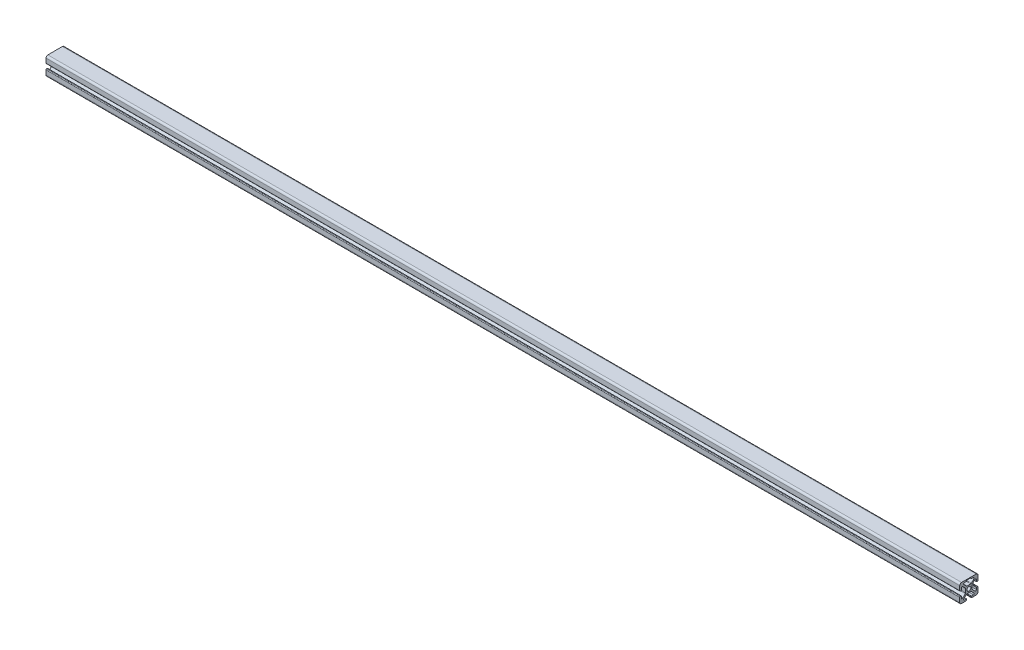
ISO-10303-21;
HEADER;
FILE_DESCRIPTION(('STEP AP214'),'2;1');
FILE_NAME('part.step','',(''),(''),'','','');
FILE_SCHEMA(('AUTOMOTIVE_DESIGN { 1 0 10303 214 1 1 1 1 }'));
ENDSEC;
DATA;
#1=APPLICATION_CONTEXT('core data for automotive mechanical design processes');
#2=APPLICATION_PROTOCOL_DEFINITION('international standard','automotive_design',2000,#1);
#3=PRODUCT_CONTEXT('',#1,'mechanical');
#4=PRODUCT('Part','Part','',(#3));
#5=PRODUCT_RELATED_PRODUCT_CATEGORY('part','',(#4));
#6=PRODUCT_DEFINITION_FORMATION('','',#4);
#7=PRODUCT_DEFINITION_CONTEXT('part definition',#1,'design');
#8=PRODUCT_DEFINITION('design','',#6,#7);
#9=PRODUCT_DEFINITION_SHAPE('','',#8);
#10=(LENGTH_UNIT() NAMED_UNIT(*) SI_UNIT(.MILLI.,.METRE.));
#11=(NAMED_UNIT(*) PLANE_ANGLE_UNIT() SI_UNIT($,.RADIAN.));
#12=(NAMED_UNIT(*) SI_UNIT($,.STERADIAN.) SOLID_ANGLE_UNIT());
#13=UNCERTAINTY_MEASURE_WITH_UNIT(LENGTH_MEASURE(1.E-05),#10,'distance_accuracy_value','');
#14=(GEOMETRIC_REPRESENTATION_CONTEXT(3) GLOBAL_UNCERTAINTY_ASSIGNED_CONTEXT((#13)) GLOBAL_UNIT_ASSIGNED_CONTEXT((#10,
#11,#12)) REPRESENTATION_CONTEXT('',''));
#15=CARTESIAN_POINT('',(0.,0.,0.));
#16=DIRECTION('',(0.,0.,1.));
#17=DIRECTION('',(1.,0.,0.));
#18=AXIS2_PLACEMENT_3D('',#15,#16,#17);
#19=CARTESIAN_POINT('',(1000.,-2.8,8.49999999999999));
#20=DIRECTION('',(-1.,0.,0.));
#21=DIRECTION('',(0.,0.,1.));
#22=AXIS2_PLACEMENT_3D('',#19,#20,#21);
#23=CYLINDRICAL_SURFACE('',#22,0.300000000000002);
#24=CARTESIAN_POINT('',(0.,-2.8,8.49999999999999));
#25=DIRECTION('',(1.,0.,0.));
#26=DIRECTION('',(0.,0.,-1.));
#27=AXIS2_PLACEMENT_3D('',#24,#25,#26);
#28=CIRCLE('',#27,0.300000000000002);
#29=CARTESIAN_POINT('',(0.,-2.8,8.19999999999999));
#30=VERTEX_POINT('',#29);
#31=CARTESIAN_POINT('',(0.,-2.5,8.5));
#32=VERTEX_POINT('',#31);
#33=EDGE_CURVE('E745',#30,#32,#28,.T.);
#34=ORIENTED_EDGE('',*,*,#33,.T.);
#35=DIRECTION('',(-1.,0.,0.));
#36=VECTOR('',#35,1.);
#37=CARTESIAN_POINT('',(1000.,-2.5,8.5));
#38=LINE('',#37,#36);
#39=CARTESIAN_POINT('',(1000.,-2.5,8.5));
#40=VERTEX_POINT('',#39);
#41=EDGE_CURVE('E13',#40,#32,#38,.T.);
#42=ORIENTED_EDGE('',*,*,#41,.F.);
#43=CARTESIAN_POINT('',(1000.,-2.8,8.49999999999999));
#44=DIRECTION('',(1.,0.,0.));
#45=DIRECTION('',(0.,0.,-1.));
#46=AXIS2_PLACEMENT_3D('',#43,#44,#45);
#47=CIRCLE('',#46,0.300000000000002);
#48=CARTESIAN_POINT('',(1000.,-2.8,8.19999999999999));
#49=VERTEX_POINT('',#48);
#50=EDGE_CURVE('E1104',#49,#40,#47,.T.);
#51=ORIENTED_EDGE('',*,*,#50,.F.);
#52=DIRECTION('',(-1.,0.,0.));
#53=VECTOR('',#52,1.);
#54=CARTESIAN_POINT('',(1000.,-2.8,8.19999999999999));
#55=LINE('',#54,#53);
#56=EDGE_CURVE('E856',#49,#30,#55,.T.);
#57=ORIENTED_EDGE('',*,*,#56,.T.);
#58=EDGE_LOOP('',(#34,#42,#51,#57));
#59=FACE_BOUND('',#58,.T.);
#60=ADVANCED_FACE('F210',(#59),#23,.T.);
#61=CARTESIAN_POINT('',(1000.,-2.5,8.5));
#62=DIRECTION('',(0.,-1.,0.));
#63=DIRECTION('',(0.,0.,-1.));
#64=AXIS2_PLACEMENT_3D('',#61,#62,#63);
#65=PLANE('',#64);
#66=DIRECTION('',(0.,0.,1.));
#67=VECTOR('',#66,1.);
#68=CARTESIAN_POINT('',(0.,-2.5,8.5));
#69=LINE('',#68,#67);
#70=CARTESIAN_POINT('',(0.,-2.5,9.30000000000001));
#71=VERTEX_POINT('',#70);
#72=EDGE_CURVE('E748',#32,#71,#69,.T.);
#73=ORIENTED_EDGE('',*,*,#72,.T.);
#74=DIRECTION('',(-1.,0.,0.));
#75=VECTOR('',#74,1.);
#76=CARTESIAN_POINT('',(1000.,-2.5,9.30000000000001));
#77=LINE('',#76,#75);
#78=CARTESIAN_POINT('',(1000.,-2.5,9.30000000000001));
#79=VERTEX_POINT('',#78);
#80=EDGE_CURVE('E220',#79,#71,#77,.T.);
#81=ORIENTED_EDGE('',*,*,#80,.F.);
#82=DIRECTION('',(0.,0.,1.));
#83=VECTOR('',#82,1.);
#84=CARTESIAN_POINT('',(1000.,-2.5,8.5));
#85=LINE('',#84,#83);
#86=EDGE_CURVE('E1106',#40,#79,#85,.T.);
#87=ORIENTED_EDGE('',*,*,#86,.F.);
#88=ORIENTED_EDGE('',*,*,#41,.T.);
#89=EDGE_LOOP('',(#73,#81,#87,#88));
#90=FACE_BOUND('',#89,.T.);
#91=ADVANCED_FACE('F1236',(#90),#65,.F.);
#92=CARTESIAN_POINT('',(1000.,-3.2,9.3));
#93=DIRECTION('',(-1.,0.,0.));
#94=DIRECTION('',(0.,0.,1.));
#95=AXIS2_PLACEMENT_3D('',#92,#93,#94);
#96=CYLINDRICAL_SURFACE('',#95,0.699999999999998);
#97=CARTESIAN_POINT('',(0.,-3.2,9.3));
#98=DIRECTION('',(1.,0.,0.));
#99=DIRECTION('',(0.,0.,-1.));
#100=AXIS2_PLACEMENT_3D('',#97,#98,#99);
#101=CIRCLE('',#100,0.699999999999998);
#102=CARTESIAN_POINT('',(0.,-3.2,10.));
#103=VERTEX_POINT('',#102);
#104=EDGE_CURVE('E750',#71,#103,#101,.T.);
#105=ORIENTED_EDGE('',*,*,#104,.T.);
#106=DIRECTION('',(-1.,0.,0.));
#107=VECTOR('',#106,1.);
#108=CARTESIAN_POINT('',(1000.,-3.2,10.));
#109=LINE('',#108,#107);
#110=CARTESIAN_POINT('',(1000.,-3.2,10.));
#111=VERTEX_POINT('',#110);
#112=EDGE_CURVE('E1007',#111,#103,#109,.T.);
#113=ORIENTED_EDGE('',*,*,#112,.F.);
#114=CARTESIAN_POINT('',(1000.,-3.2,9.3));
#115=DIRECTION('',(1.,0.,0.));
#116=DIRECTION('',(0.,0.,-1.));
#117=AXIS2_PLACEMENT_3D('',#114,#115,#116);
#118=CIRCLE('',#117,0.699999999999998);
#119=EDGE_CURVE('E1108',#79,#111,#118,.T.);
#120=ORIENTED_EDGE('',*,*,#119,.F.);
#121=ORIENTED_EDGE('',*,*,#80,.T.);
#122=EDGE_LOOP('',(#105,#113,#120,#121));
#123=FACE_BOUND('',#122,.T.);
#124=ADVANCED_FACE('F1241',(#123),#96,.T.);
#125=CARTESIAN_POINT('',(1000.,-3.2,10.));
#126=DIRECTION('',(0.,0.,-1.));
#127=DIRECTION('',(-1.,0.,0.));
#128=AXIS2_PLACEMENT_3D('',#125,#126,#127);
#129=PLANE('',#128);
#130=DIRECTION('',(0.,-1.,0.));
#131=VECTOR('',#130,1.);
#132=CARTESIAN_POINT('',(0.,-3.2,10.));
#133=LINE('',#132,#131);
#134=CARTESIAN_POINT('',(0.,-8.,10.));
#135=VERTEX_POINT('',#134);
#136=EDGE_CURVE('E752',#103,#135,#133,.T.);
#137=ORIENTED_EDGE('',*,*,#136,.T.);
#138=DIRECTION('',(-1.,0.,0.));
#139=VECTOR('',#138,1.);
#140=CARTESIAN_POINT('',(1000.,-8.,10.));
#141=LINE('',#140,#139);
#142=CARTESIAN_POINT('',(1000.,-8.,10.));
#143=VERTEX_POINT('',#142);
#144=EDGE_CURVE('E1004',#143,#135,#141,.T.);
#145=ORIENTED_EDGE('',*,*,#144,.F.);
#146=DIRECTION('',(0.,-1.,0.));
#147=VECTOR('',#146,1.);
#148=CARTESIAN_POINT('',(1000.,-3.2,10.));
#149=LINE('',#148,#147);
#150=EDGE_CURVE('E1110',#111,#143,#149,.T.);
#151=ORIENTED_EDGE('',*,*,#150,.F.);
#152=ORIENTED_EDGE('',*,*,#112,.T.);
#153=EDGE_LOOP('',(#137,#145,#151,#152));
#154=FACE_BOUND('',#153,.T.);
#155=ADVANCED_FACE('F1498',(#154),#129,.F.);
#156=CARTESIAN_POINT('',(1000.,-8.,8.));
#157=DIRECTION('',(-1.,0.,0.));
#158=DIRECTION('',(0.,0.,1.));
#159=AXIS2_PLACEMENT_3D('',#156,#157,#158);
#160=CYLINDRICAL_SURFACE('',#159,2.);
#161=CARTESIAN_POINT('',(0.,-8.,8.));
#162=DIRECTION('',(1.,0.,0.));
#163=DIRECTION('',(0.,0.,-1.));
#164=AXIS2_PLACEMENT_3D('',#161,#162,#163);
#165=CIRCLE('',#164,2.);
#166=CARTESIAN_POINT('',(0.,-10.,8.));
#167=VERTEX_POINT('',#166);
#168=EDGE_CURVE('E754',#135,#167,#165,.T.);
#169=ORIENTED_EDGE('',*,*,#168,.T.);
#170=DIRECTION('',(-1.,0.,0.));
#171=VECTOR('',#170,1.);
#172=CARTESIAN_POINT('',(1000.,-10.,8.));
#173=LINE('',#172,#171);
#174=CARTESIAN_POINT('',(1000.,-10.,8.));
#175=VERTEX_POINT('',#174);
#176=EDGE_CURVE('E1001',#175,#167,#173,.T.);
#177=ORIENTED_EDGE('',*,*,#176,.F.);
#178=CARTESIAN_POINT('',(1000.,-8.,8.));
#179=DIRECTION('',(1.,0.,0.));
#180=DIRECTION('',(0.,0.,-1.));
#181=AXIS2_PLACEMENT_3D('',#178,#179,#180);
#182=CIRCLE('',#181,2.);
#183=EDGE_CURVE('E1112',#143,#175,#182,.T.);
#184=ORIENTED_EDGE('',*,*,#183,.F.);
#185=ORIENTED_EDGE('',*,*,#144,.T.);
#186=EDGE_LOOP('',(#169,#177,#184,#185));
#187=FACE_BOUND('',#186,.T.);
#188=ADVANCED_FACE('F1494',(#187),#160,.T.);
#189=CARTESIAN_POINT('',(1000.,-10.,8.));
#190=DIRECTION('',(0.,1.,0.));
#191=DIRECTION('',(0.,0.,1.));
#192=AXIS2_PLACEMENT_3D('',#189,#190,#191);
#193=PLANE('',#192);
#194=DIRECTION('',(0.,0.,-1.));
#195=VECTOR('',#194,1.);
#196=CARTESIAN_POINT('',(0.,-10.,8.));
#197=LINE('',#196,#195);
#198=CARTESIAN_POINT('',(0.,-10.,3.19999999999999));
#199=VERTEX_POINT('',#198);
#200=EDGE_CURVE('E756',#167,#199,#197,.T.);
#201=ORIENTED_EDGE('',*,*,#200,.T.);
#202=DIRECTION('',(-1.,0.,0.));
#203=VECTOR('',#202,1.);
#204=CARTESIAN_POINT('',(1000.,-10.,3.19999999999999));
#205=LINE('',#204,#203);
#206=CARTESIAN_POINT('',(1000.,-10.,3.19999999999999));
#207=VERTEX_POINT('',#206);
#208=EDGE_CURVE('E998',#207,#199,#205,.T.);
#209=ORIENTED_EDGE('',*,*,#208,.F.);
#210=DIRECTION('',(0.,0.,-1.));
#211=VECTOR('',#210,1.);
#212=CARTESIAN_POINT('',(1000.,-10.,8.));
#213=LINE('',#212,#211);
#214=EDGE_CURVE('E1114',#175,#207,#213,.T.);
#215=ORIENTED_EDGE('',*,*,#214,.F.);
#216=ORIENTED_EDGE('',*,*,#176,.T.);
#217=EDGE_LOOP('',(#201,#209,#215,#216));
#218=FACE_BOUND('',#217,.T.);
#219=ADVANCED_FACE('F1490',(#218),#193,.F.);
#220=CARTESIAN_POINT('',(1000.,-9.30000000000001,3.19999999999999));
#221=DIRECTION('',(-1.,0.,0.));
#222=DIRECTION('',(0.,0.,1.));
#223=AXIS2_PLACEMENT_3D('',#220,#221,#222);
#224=CYLINDRICAL_SURFACE('',#223,0.699999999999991);
#225=CARTESIAN_POINT('',(0.,-9.30000000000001,3.19999999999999));
#226=DIRECTION('',(1.,0.,0.));
#227=DIRECTION('',(0.,0.,-1.));
#228=AXIS2_PLACEMENT_3D('',#225,#226,#227);
#229=CIRCLE('',#228,0.699999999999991);
#230=CARTESIAN_POINT('',(0.,-9.30000000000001,2.5));
#231=VERTEX_POINT('',#230);
#232=EDGE_CURVE('E758',#199,#231,#229,.T.);
#233=ORIENTED_EDGE('',*,*,#232,.T.);
#234=DIRECTION('',(-1.,0.,0.));
#235=VECTOR('',#234,1.);
#236=CARTESIAN_POINT('',(1000.,-9.30000000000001,2.5));
#237=LINE('',#236,#235);
#238=CARTESIAN_POINT('',(1000.,-9.30000000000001,2.5));
#239=VERTEX_POINT('',#238);
#240=EDGE_CURVE('E995',#239,#231,#237,.T.);
#241=ORIENTED_EDGE('',*,*,#240,.F.);
#242=CARTESIAN_POINT('',(1000.,-9.30000000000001,3.19999999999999));
#243=DIRECTION('',(1.,0.,0.));
#244=DIRECTION('',(0.,0.,-1.));
#245=AXIS2_PLACEMENT_3D('',#242,#243,#244);
#246=CIRCLE('',#245,0.699999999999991);
#247=EDGE_CURVE('E1116',#207,#239,#246,.T.);
#248=ORIENTED_EDGE('',*,*,#247,.F.);
#249=ORIENTED_EDGE('',*,*,#208,.T.);
#250=EDGE_LOOP('',(#233,#241,#248,#249));
#251=FACE_BOUND('',#250,.T.);
#252=ADVANCED_FACE('F1486',(#251),#224,.T.);
#253=CARTESIAN_POINT('',(1000.,-9.30000000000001,2.5));
#254=DIRECTION('',(0.,0.,1.));
#255=DIRECTION('',(1.,0.,0.));
#256=AXIS2_PLACEMENT_3D('',#253,#254,#255);
#257=PLANE('',#256);
#258=DIRECTION('',(0.,1.,0.));
#259=VECTOR('',#258,1.);
#260=CARTESIAN_POINT('',(0.,-9.30000000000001,2.5));
#261=LINE('',#260,#259);
#262=CARTESIAN_POINT('',(0.,-8.5,2.5));
#263=VERTEX_POINT('',#262);
#264=EDGE_CURVE('E760',#231,#263,#261,.T.);
#265=ORIENTED_EDGE('',*,*,#264,.T.);
#266=DIRECTION('',(-1.,0.,0.));
#267=VECTOR('',#266,1.);
#268=CARTESIAN_POINT('',(1000.,-8.5,2.5));
#269=LINE('',#268,#267);
#270=CARTESIAN_POINT('',(1000.,-8.5,2.5));
#271=VERTEX_POINT('',#270);
#272=EDGE_CURVE('E992',#271,#263,#269,.T.);
#273=ORIENTED_EDGE('',*,*,#272,.F.);
#274=DIRECTION('',(0.,1.,0.));
#275=VECTOR('',#274,1.);
#276=CARTESIAN_POINT('',(1000.,-9.30000000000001,2.5));
#277=LINE('',#276,#275);
#278=EDGE_CURVE('E1118',#239,#271,#277,.T.);
#279=ORIENTED_EDGE('',*,*,#278,.F.);
#280=ORIENTED_EDGE('',*,*,#240,.T.);
#281=EDGE_LOOP('',(#265,#273,#279,#280));
#282=FACE_BOUND('',#281,.T.);
#283=ADVANCED_FACE('F1482',(#282),#257,.F.);
#284=CARTESIAN_POINT('',(1000.,-8.5,2.8));
#285=DIRECTION('',(-1.,0.,0.));
#286=DIRECTION('',(0.,0.,1.));
#287=AXIS2_PLACEMENT_3D('',#284,#285,#286);
#288=CYLINDRICAL_SURFACE('',#287,0.3);
#289=CARTESIAN_POINT('',(0.,-8.5,2.8));
#290=DIRECTION('',(1.,0.,0.));
#291=DIRECTION('',(0.,0.,-1.));
#292=AXIS2_PLACEMENT_3D('',#289,#290,#291);
#293=CIRCLE('',#292,0.3);
#294=CARTESIAN_POINT('',(0.,-8.2,2.80000000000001));
#295=VERTEX_POINT('',#294);
#296=EDGE_CURVE('E762',#263,#295,#293,.T.);
#297=ORIENTED_EDGE('',*,*,#296,.T.);
#298=DIRECTION('',(-1.,0.,0.));
#299=VECTOR('',#298,1.);
#300=CARTESIAN_POINT('',(1000.,-8.2,2.80000000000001));
#301=LINE('',#300,#299);
#302=CARTESIAN_POINT('',(1000.,-8.2,2.80000000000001));
#303=VERTEX_POINT('',#302);
#304=EDGE_CURVE('E989',#303,#295,#301,.T.);
#305=ORIENTED_EDGE('',*,*,#304,.F.);
#306=CARTESIAN_POINT('',(1000.,-8.5,2.8));
#307=DIRECTION('',(1.,0.,0.));
#308=DIRECTION('',(0.,0.,-1.));
#309=AXIS2_PLACEMENT_3D('',#306,#307,#308);
#310=CIRCLE('',#309,0.3);
#311=EDGE_CURVE('E1120',#271,#303,#310,.T.);
#312=ORIENTED_EDGE('',*,*,#311,.F.);
#313=ORIENTED_EDGE('',*,*,#272,.T.);
#314=EDGE_LOOP('',(#297,#305,#312,#313));
#315=FACE_BOUND('',#314,.T.);
#316=ADVANCED_FACE('F1478',(#315),#288,.T.);
#317=CARTESIAN_POINT('',(1000.,-8.2,2.80000000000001));
#318=DIRECTION('',(0.,-1.,0.));
#319=DIRECTION('',(0.,0.,-1.));
#320=AXIS2_PLACEMENT_3D('',#317,#318,#319);
#321=PLANE('',#320);
#322=DIRECTION('',(0.,0.,1.));
#323=VECTOR('',#322,1.);
#324=CARTESIAN_POINT('',(0.,-8.2,2.80000000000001));
#325=LINE('',#324,#323);
#326=CARTESIAN_POINT('',(0.,-8.2,4.86758838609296));
#327=VERTEX_POINT('',#326);
#328=EDGE_CURVE('E764',#295,#327,#325,.T.);
#329=ORIENTED_EDGE('',*,*,#328,.T.);
#330=DIRECTION('',(-1.,0.,0.));
#331=VECTOR('',#330,1.);
#332=CARTESIAN_POINT('',(1000.,-8.2,4.86758838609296));
#333=LINE('',#332,#331);
#334=CARTESIAN_POINT('',(1000.,-8.2,4.86758838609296));
#335=VERTEX_POINT('',#334);
#336=EDGE_CURVE('E986',#335,#327,#333,.T.);
#337=ORIENTED_EDGE('',*,*,#336,.F.);
#338=DIRECTION('',(0.,0.,1.));
#339=VECTOR('',#338,1.);
#340=CARTESIAN_POINT('',(1000.,-8.2,2.80000000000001));
#341=LINE('',#340,#339);
#342=EDGE_CURVE('E1122',#303,#335,#341,.T.);
#343=ORIENTED_EDGE('',*,*,#342,.F.);
#344=ORIENTED_EDGE('',*,*,#304,.T.);
#345=EDGE_LOOP('',(#329,#337,#343,#344));
#346=FACE_BOUND('',#345,.T.);
#347=ADVANCED_FACE('F1474',(#346),#321,.F.);
#348=CARTESIAN_POINT('',(1000.,-7.31758838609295,4.86758838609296));
#349=DIRECTION('',(-1.,0.,0.));
#350=DIRECTION('',(0.,0.,1.));
#351=AXIS2_PLACEMENT_3D('',#348,#349,#350);
#352=CYLINDRICAL_SURFACE('',#351,0.882411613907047);
#353=CARTESIAN_POINT('',(0.,-7.31758838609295,4.86758838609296));
#354=DIRECTION('',(-1.,0.,0.));
#355=DIRECTION('',(0.,0.,-1.));
#356=AXIS2_PLACEMENT_3D('',#353,#354,#355);
#357=CIRCLE('',#356,0.882411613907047);
#358=CARTESIAN_POINT('',(0.,-6.69362915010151,5.4915476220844));
#359=VERTEX_POINT('',#358);
#360=EDGE_CURVE('E766',#327,#359,#357,.T.);
#361=ORIENTED_EDGE('',*,*,#360,.T.);
#362=DIRECTION('',(-1.,0.,0.));
#363=VECTOR('',#362,1.);
#364=CARTESIAN_POINT('',(1000.,-6.69362915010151,5.4915476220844));
#365=LINE('',#364,#363);
#366=CARTESIAN_POINT('',(1000.,-6.69362915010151,5.4915476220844));
#367=VERTEX_POINT('',#366);
#368=EDGE_CURVE('E983',#367,#359,#365,.T.);
#369=ORIENTED_EDGE('',*,*,#368,.F.);
#370=CARTESIAN_POINT('',(1000.,-7.31758838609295,4.86758838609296));
#371=DIRECTION('',(-1.,0.,0.));
#372=DIRECTION('',(0.,0.,-1.));
#373=AXIS2_PLACEMENT_3D('',#370,#371,#372);
#374=CIRCLE('',#373,0.882411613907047);
#375=EDGE_CURVE('E1124',#335,#367,#374,.T.);
#376=ORIENTED_EDGE('',*,*,#375,.F.);
#377=ORIENTED_EDGE('',*,*,#336,.T.);
#378=EDGE_LOOP('',(#361,#369,#376,#377));
#379=FACE_BOUND('',#378,.T.);
#380=ADVANCED_FACE('F1470',(#379),#352,.F.);
#381=CARTESIAN_POINT('',(1000.,-6.69362915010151,5.4915476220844));
#382=DIRECTION('',(0.,0.707106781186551,0.707106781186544));
#383=DIRECTION('',(0.,-0.707106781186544,0.707106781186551));
#384=AXIS2_PLACEMENT_3D('',#381,#382,#383);
#385=PLANE('',#384);
#386=DIRECTION('',(0.,0.707106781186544,-0.707106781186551));
#387=VECTOR('',#386,1.);
#388=CARTESIAN_POINT('',(0.,-6.69362915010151,5.4915476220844));
#389=LINE('',#388,#387);
#390=CARTESIAN_POINT('',(0.,-3.94289321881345,2.74081169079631));
#391=VERTEX_POINT('',#390);
#392=EDGE_CURVE('E768',#359,#391,#389,.T.);
#393=ORIENTED_EDGE('',*,*,#392,.T.);
#394=DIRECTION('',(-1.,0.,0.));
#395=VECTOR('',#394,1.);
#396=CARTESIAN_POINT('',(1000.,-3.94289321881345,2.74081169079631));
#397=LINE('',#396,#395);
#398=CARTESIAN_POINT('',(1000.,-3.94289321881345,2.74081169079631));
#399=VERTEX_POINT('',#398);
#400=EDGE_CURVE('E980',#399,#391,#397,.T.);
#401=ORIENTED_EDGE('',*,*,#400,.F.);
#402=DIRECTION('',(0.,0.707106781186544,-0.707106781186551));
#403=VECTOR('',#402,1.);
#404=CARTESIAN_POINT('',(1000.,-6.69362915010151,5.4915476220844));
#405=LINE('',#404,#403);
#406=EDGE_CURVE('E1126',#367,#399,#405,.T.);
#407=ORIENTED_EDGE('',*,*,#406,.F.);
#408=ORIENTED_EDGE('',*,*,#368,.T.);
#409=EDGE_LOOP('',(#393,#401,#407,#408));
#410=FACE_BOUND('',#409,.T.);
#411=ADVANCED_FACE('F1466',(#410),#385,.F.);
#412=CARTESIAN_POINT('',(1000.,-4.64999999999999,2.03370490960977));
#413=DIRECTION('',(-1.,0.,0.));
#414=DIRECTION('',(0.,0.,1.));
#415=AXIS2_PLACEMENT_3D('',#412,#413,#414);
#416=CYLINDRICAL_SURFACE('',#415,0.999999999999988);
#417=CARTESIAN_POINT('',(0.,-4.64999999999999,2.03370490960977));
#418=DIRECTION('',(-1.,0.,0.));
#419=DIRECTION('',(0.,0.,-1.));
#420=AXIS2_PLACEMENT_3D('',#417,#418,#419);
#421=CIRCLE('',#420,0.999999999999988);
#422=CARTESIAN_POINT('',(0.,-3.65000000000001,2.03370490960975));
#423=VERTEX_POINT('',#422);
#424=EDGE_CURVE('E770',#391,#423,#421,.T.);
#425=ORIENTED_EDGE('',*,*,#424,.T.);
#426=DIRECTION('',(-1.,0.,0.));
#427=VECTOR('',#426,1.);
#428=CARTESIAN_POINT('',(1000.,-3.65000000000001,2.03370490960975));
#429=LINE('',#428,#427);
#430=CARTESIAN_POINT('',(1000.,-3.65000000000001,2.03370490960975));
#431=VERTEX_POINT('',#430);
#432=EDGE_CURVE('E977',#431,#423,#429,.T.);
#433=ORIENTED_EDGE('',*,*,#432,.F.);
#434=CARTESIAN_POINT('',(1000.,-4.64999999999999,2.03370490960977));
#435=DIRECTION('',(-1.,0.,0.));
#436=DIRECTION('',(0.,0.,-1.));
#437=AXIS2_PLACEMENT_3D('',#434,#435,#436);
#438=CIRCLE('',#437,0.999999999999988);
#439=EDGE_CURVE('E1128',#399,#431,#438,.T.);
#440=ORIENTED_EDGE('',*,*,#439,.F.);
#441=ORIENTED_EDGE('',*,*,#400,.T.);
#442=EDGE_LOOP('',(#425,#433,#440,#441));
#443=FACE_BOUND('',#442,.T.);
#444=ADVANCED_FACE('F1462',(#443),#416,.F.);
#445=CARTESIAN_POINT('',(1000.,-3.65000000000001,2.03370490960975));
#446=DIRECTION('',(0.,1.,0.));
#447=DIRECTION('',(0.,0.,1.));
#448=AXIS2_PLACEMENT_3D('',#445,#446,#447);
#449=PLANE('',#448);
#450=DIRECTION('',(0.,0.,-1.));
#451=VECTOR('',#450,1.);
#452=CARTESIAN_POINT('',(0.,-3.65000000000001,2.03370490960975));
#453=LINE('',#452,#451);
#454=CARTESIAN_POINT('',(0.,-3.64999999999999,-2.03370490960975));
#455=VERTEX_POINT('',#454);
#456=EDGE_CURVE('E772',#423,#455,#453,.T.);
#457=ORIENTED_EDGE('',*,*,#456,.T.);
#458=DIRECTION('',(-1.,0.,0.));
#459=VECTOR('',#458,1.);
#460=CARTESIAN_POINT('',(1000.,-3.64999999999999,-2.03370490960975));
#461=LINE('',#460,#459);
#462=CARTESIAN_POINT('',(1000.,-3.64999999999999,-2.03370490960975));
#463=VERTEX_POINT('',#462);
#464=EDGE_CURVE('E974',#463,#455,#461,.T.);
#465=ORIENTED_EDGE('',*,*,#464,.F.);
#466=DIRECTION('',(0.,0.,-1.));
#467=VECTOR('',#466,1.);
#468=CARTESIAN_POINT('',(1000.,-3.65000000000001,2.03370490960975));
#469=LINE('',#468,#467);
#470=EDGE_CURVE('E1130',#431,#463,#469,.T.);
#471=ORIENTED_EDGE('',*,*,#470,.F.);
#472=ORIENTED_EDGE('',*,*,#432,.T.);
#473=EDGE_LOOP('',(#457,#465,#471,#472));
#474=FACE_BOUND('',#473,.T.);
#475=ADVANCED_FACE('F1458',(#474),#449,.F.);
#476=CARTESIAN_POINT('',(1000.,-4.65,-2.03370490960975));
#477=DIRECTION('',(-1.,0.,0.));
#478=DIRECTION('',(0.,0.,1.));
#479=AXIS2_PLACEMENT_3D('',#476,#477,#478);
#480=CYLINDRICAL_SURFACE('',#479,1.00000000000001);
#481=CARTESIAN_POINT('',(0.,-4.65,-2.03370490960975));
#482=DIRECTION('',(-1.,0.,0.));
#483=DIRECTION('',(0.,0.,-1.));
#484=AXIS2_PLACEMENT_3D('',#481,#482,#483);
#485=CIRCLE('',#484,1.00000000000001);
#486=CARTESIAN_POINT('',(0.,-3.94289321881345,-2.74081169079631));
#487=VERTEX_POINT('',#486);
#488=EDGE_CURVE('E774',#455,#487,#485,.T.);
#489=ORIENTED_EDGE('',*,*,#488,.T.);
#490=DIRECTION('',(-1.,0.,0.));
#491=VECTOR('',#490,1.);
#492=CARTESIAN_POINT('',(1000.,-3.94289321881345,-2.74081169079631));
#493=LINE('',#492,#491);
#494=CARTESIAN_POINT('',(1000.,-3.94289321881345,-2.74081169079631));
#495=VERTEX_POINT('',#494);
#496=EDGE_CURVE('E971',#495,#487,#493,.T.);
#497=ORIENTED_EDGE('',*,*,#496,.F.);
#498=CARTESIAN_POINT('',(1000.,-4.65,-2.03370490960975));
#499=DIRECTION('',(-1.,0.,0.));
#500=DIRECTION('',(0.,0.,-1.));
#501=AXIS2_PLACEMENT_3D('',#498,#499,#500);
#502=CIRCLE('',#501,1.00000000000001);
#503=EDGE_CURVE('E1132',#463,#495,#502,.T.);
#504=ORIENTED_EDGE('',*,*,#503,.F.);
#505=ORIENTED_EDGE('',*,*,#464,.T.);
#506=EDGE_LOOP('',(#489,#497,#504,#505));
#507=FACE_BOUND('',#506,.T.);
#508=ADVANCED_FACE('F1454',(#507),#480,.F.);
#509=CARTESIAN_POINT('',(1000.,-3.94289321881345,-2.74081169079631));
#510=DIRECTION('',(0.,0.707106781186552,-0.707106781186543));
#511=DIRECTION('',(0.,0.707106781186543,0.707106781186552));
#512=AXIS2_PLACEMENT_3D('',#509,#510,#511);
#513=PLANE('',#512);
#514=DIRECTION('',(0.,-0.707106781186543,-0.707106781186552));
#515=VECTOR('',#514,1.);
#516=CARTESIAN_POINT('',(0.,-3.94289321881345,-2.74081169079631));
#517=LINE('',#516,#515);
#518=CARTESIAN_POINT('',(0.,-6.69362915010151,-5.4915476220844));
#519=VERTEX_POINT('',#518);
#520=EDGE_CURVE('E776',#487,#519,#517,.T.);
#521=ORIENTED_EDGE('',*,*,#520,.T.);
#522=DIRECTION('',(-1.,0.,0.));
#523=VECTOR('',#522,1.);
#524=CARTESIAN_POINT('',(1000.,-6.69362915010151,-5.4915476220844));
#525=LINE('',#524,#523);
#526=CARTESIAN_POINT('',(1000.,-6.69362915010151,-5.4915476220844));
#527=VERTEX_POINT('',#526);
#528=EDGE_CURVE('E968',#527,#519,#525,.T.);
#529=ORIENTED_EDGE('',*,*,#528,.F.);
#530=DIRECTION('',(0.,-0.707106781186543,-0.707106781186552));
#531=VECTOR('',#530,1.);
#532=CARTESIAN_POINT('',(1000.,-3.94289321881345,-2.74081169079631));
#533=LINE('',#532,#531);
#534=EDGE_CURVE('E1134',#495,#527,#533,.T.);
#535=ORIENTED_EDGE('',*,*,#534,.F.);
#536=ORIENTED_EDGE('',*,*,#496,.T.);
#537=EDGE_LOOP('',(#521,#529,#535,#536));
#538=FACE_BOUND('',#537,.T.);
#539=ADVANCED_FACE('F1450',(#538),#513,.F.);
#540=CARTESIAN_POINT('',(1000.,-7.31758838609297,-4.86758838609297));
#541=DIRECTION('',(-1.,0.,0.));
#542=DIRECTION('',(0.,0.,1.));
#543=AXIS2_PLACEMENT_3D('',#540,#541,#542);
#544=CYLINDRICAL_SURFACE('',#543,0.88241161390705);
#545=CARTESIAN_POINT('',(0.,-7.31758838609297,-4.86758838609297));
#546=DIRECTION('',(-1.,0.,0.));
#547=DIRECTION('',(0.,0.,-1.));
#548=AXIS2_PLACEMENT_3D('',#545,#546,#547);
#549=CIRCLE('',#548,0.88241161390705);
#550=CARTESIAN_POINT('',(0.,-8.20000000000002,-4.86758838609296));
#551=VERTEX_POINT('',#550);
#552=EDGE_CURVE('E778',#519,#551,#549,.T.);
#553=ORIENTED_EDGE('',*,*,#552,.T.);
#554=DIRECTION('',(-1.,0.,0.));
#555=VECTOR('',#554,1.);
#556=CARTESIAN_POINT('',(1000.,-8.20000000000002,-4.86758838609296));
#557=LINE('',#556,#555);
#558=CARTESIAN_POINT('',(1000.,-8.20000000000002,-4.86758838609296));
#559=VERTEX_POINT('',#558);
#560=EDGE_CURVE('E965',#559,#551,#557,.T.);
#561=ORIENTED_EDGE('',*,*,#560,.F.);
#562=CARTESIAN_POINT('',(1000.,-7.31758838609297,-4.86758838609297));
#563=DIRECTION('',(-1.,0.,0.));
#564=DIRECTION('',(0.,0.,-1.));
#565=AXIS2_PLACEMENT_3D('',#562,#563,#564);
#566=CIRCLE('',#565,0.88241161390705);
#567=EDGE_CURVE('E1136',#527,#559,#566,.T.);
#568=ORIENTED_EDGE('',*,*,#567,.F.);
#569=ORIENTED_EDGE('',*,*,#528,.T.);
#570=EDGE_LOOP('',(#553,#561,#568,#569));
#571=FACE_BOUND('',#570,.T.);
#572=ADVANCED_FACE('F1446',(#571),#544,.F.);
#573=CARTESIAN_POINT('',(1000.,-8.20000000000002,-4.86758838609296));
#574=DIRECTION('',(0.,-1.,0.));
#575=DIRECTION('',(0.,0.,-1.));
#576=AXIS2_PLACEMENT_3D('',#573,#574,#575);
#577=PLANE('',#576);
#578=DIRECTION('',(0.,0.,1.));
#579=VECTOR('',#578,1.);
#580=CARTESIAN_POINT('',(0.,-8.20000000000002,-4.86758838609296));
#581=LINE('',#580,#579);
#582=CARTESIAN_POINT('',(0.,-8.19999999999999,-2.80000000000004));
#583=VERTEX_POINT('',#582);
#584=EDGE_CURVE('E780',#551,#583,#581,.T.);
#585=ORIENTED_EDGE('',*,*,#584,.T.);
#586=DIRECTION('',(-1.,0.,0.));
#587=VECTOR('',#586,1.);
#588=CARTESIAN_POINT('',(1000.,-8.19999999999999,-2.80000000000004));
#589=LINE('',#588,#587);
#590=CARTESIAN_POINT('',(1000.,-8.19999999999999,-2.80000000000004));
#591=VERTEX_POINT('',#590);
#592=EDGE_CURVE('E962',#591,#583,#589,.T.);
#593=ORIENTED_EDGE('',*,*,#592,.F.);
#594=DIRECTION('',(0.,0.,1.));
#595=VECTOR('',#594,1.);
#596=CARTESIAN_POINT('',(1000.,-8.20000000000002,-4.86758838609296));
#597=LINE('',#596,#595);
#598=EDGE_CURVE('E1138',#559,#591,#597,.T.);
#599=ORIENTED_EDGE('',*,*,#598,.F.);
#600=ORIENTED_EDGE('',*,*,#560,.T.);
#601=EDGE_LOOP('',(#585,#593,#599,#600));
#602=FACE_BOUND('',#601,.T.);
#603=ADVANCED_FACE('F1442',(#602),#577,.F.);
#604=CARTESIAN_POINT('',(1000.,-8.49999999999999,-2.80000000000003));
#605=DIRECTION('',(-1.,0.,0.));
#606=DIRECTION('',(0.,0.,1.));
#607=AXIS2_PLACEMENT_3D('',#604,#605,#606);
#608=CYLINDRICAL_SURFACE('',#607,0.300000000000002);
#609=CARTESIAN_POINT('',(0.,-8.49999999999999,-2.80000000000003));
#610=DIRECTION('',(1.,0.,0.));
#611=DIRECTION('',(0.,0.,-1.));
#612=AXIS2_PLACEMENT_3D('',#609,#610,#611);
#613=CIRCLE('',#612,0.300000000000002);
#614=CARTESIAN_POINT('',(0.,-8.49999999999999,-2.50000000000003));
#615=VERTEX_POINT('',#614);
#616=EDGE_CURVE('E782',#583,#615,#613,.T.);
#617=ORIENTED_EDGE('',*,*,#616,.T.);
#618=DIRECTION('',(-1.,0.,0.));
#619=VECTOR('',#618,1.);
#620=CARTESIAN_POINT('',(1000.,-8.49999999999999,-2.50000000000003));
#621=LINE('',#620,#619);
#622=CARTESIAN_POINT('',(1000.,-8.49999999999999,-2.50000000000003));
#623=VERTEX_POINT('',#622);
#624=EDGE_CURVE('E959',#623,#615,#621,.T.);
#625=ORIENTED_EDGE('',*,*,#624,.F.);
#626=CARTESIAN_POINT('',(1000.,-8.49999999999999,-2.80000000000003));
#627=DIRECTION('',(1.,0.,0.));
#628=DIRECTION('',(0.,0.,-1.));
#629=AXIS2_PLACEMENT_3D('',#626,#627,#628);
#630=CIRCLE('',#629,0.300000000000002);
#631=EDGE_CURVE('E1140',#591,#623,#630,.T.);
#632=ORIENTED_EDGE('',*,*,#631,.F.);
#633=ORIENTED_EDGE('',*,*,#592,.T.);
#634=EDGE_LOOP('',(#617,#625,#632,#633));
#635=FACE_BOUND('',#634,.T.);
#636=ADVANCED_FACE('F1438',(#635),#608,.T.);
#637=CARTESIAN_POINT('',(1000.,-8.49999999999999,-2.50000000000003));
#638=DIRECTION('',(0.,0.,-1.));
#639=DIRECTION('',(-1.,0.,0.));
#640=AXIS2_PLACEMENT_3D('',#637,#638,#639);
#641=PLANE('',#640);
#642=DIRECTION('',(0.,-1.,0.));
#643=VECTOR('',#642,1.);
#644=CARTESIAN_POINT('',(0.,-8.49999999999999,-2.50000000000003));
#645=LINE('',#644,#643);
#646=CARTESIAN_POINT('',(0.,-9.30000000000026,-2.50000000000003));
#647=VERTEX_POINT('',#646);
#648=EDGE_CURVE('E784',#615,#647,#645,.T.);
#649=ORIENTED_EDGE('',*,*,#648,.T.);
#650=DIRECTION('',(-1.,0.,0.));
#651=VECTOR('',#650,1.);
#652=CARTESIAN_POINT('',(1000.,-9.30000000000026,-2.50000000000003));
#653=LINE('',#652,#651);
#654=CARTESIAN_POINT('',(1000.,-9.30000000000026,-2.50000000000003));
#655=VERTEX_POINT('',#654);
#656=EDGE_CURVE('E956',#655,#647,#653,.T.);
#657=ORIENTED_EDGE('',*,*,#656,.F.);
#658=DIRECTION('',(0.,-1.,0.));
#659=VECTOR('',#658,1.);
#660=CARTESIAN_POINT('',(1000.,-8.49999999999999,-2.50000000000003));
#661=LINE('',#660,#659);
#662=EDGE_CURVE('E1142',#623,#655,#661,.T.);
#663=ORIENTED_EDGE('',*,*,#662,.F.);
#664=ORIENTED_EDGE('',*,*,#624,.T.);
#665=EDGE_LOOP('',(#649,#657,#663,#664));
#666=FACE_BOUND('',#665,.T.);
#667=ADVANCED_FACE('F1434',(#666),#641,.F.);
#668=CARTESIAN_POINT('',(1000.,-9.30000000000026,-3.20000000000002));
#669=DIRECTION('',(-1.,0.,0.));
#670=DIRECTION('',(0.,0.,1.));
#671=AXIS2_PLACEMENT_3D('',#668,#669,#670);
#672=CYLINDRICAL_SURFACE('',#671,0.699999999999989);
#673=CARTESIAN_POINT('',(0.,-9.30000000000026,-3.20000000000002));
#674=DIRECTION('',(1.,0.,0.));
#675=DIRECTION('',(0.,0.,-1.));
#676=AXIS2_PLACEMENT_3D('',#673,#674,#675);
#677=CIRCLE('',#676,0.699999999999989);
#678=CARTESIAN_POINT('',(0.,-10.0000000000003,-3.20000000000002));
#679=VERTEX_POINT('',#678);
#680=EDGE_CURVE('E786',#647,#679,#677,.T.);
#681=ORIENTED_EDGE('',*,*,#680,.T.);
#682=DIRECTION('',(-1.,0.,0.));
#683=VECTOR('',#682,1.);
#684=CARTESIAN_POINT('',(1000.,-10.0000000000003,-3.20000000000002));
#685=LINE('',#684,#683);
#686=CARTESIAN_POINT('',(1000.,-10.0000000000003,-3.20000000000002));
#687=VERTEX_POINT('',#686);
#688=EDGE_CURVE('E953',#687,#679,#685,.T.);
#689=ORIENTED_EDGE('',*,*,#688,.F.);
#690=CARTESIAN_POINT('',(1000.,-9.30000000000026,-3.20000000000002));
#691=DIRECTION('',(1.,0.,0.));
#692=DIRECTION('',(0.,0.,-1.));
#693=AXIS2_PLACEMENT_3D('',#690,#691,#692);
#694=CIRCLE('',#693,0.699999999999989);
#695=EDGE_CURVE('E1144',#655,#687,#694,.T.);
#696=ORIENTED_EDGE('',*,*,#695,.F.);
#697=ORIENTED_EDGE('',*,*,#656,.T.);
#698=EDGE_LOOP('',(#681,#689,#696,#697));
#699=FACE_BOUND('',#698,.T.);
#700=ADVANCED_FACE('F1430',(#699),#672,.T.);
#701=CARTESIAN_POINT('',(1000.,-10.0000000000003,-3.20000000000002));
#702=DIRECTION('',(0.,1.,0.));
#703=DIRECTION('',(0.,0.,1.));
#704=AXIS2_PLACEMENT_3D('',#701,#702,#703);
#705=PLANE('',#704);
#706=DIRECTION('',(0.,0.,-1.));
#707=VECTOR('',#706,1.);
#708=CARTESIAN_POINT('',(0.,-10.0000000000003,-3.20000000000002));
#709=LINE('',#708,#707);
#710=CARTESIAN_POINT('',(0.,-10.0000000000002,-8.00000000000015));
#711=VERTEX_POINT('',#710);
#712=EDGE_CURVE('E788',#679,#711,#709,.T.);
#713=ORIENTED_EDGE('',*,*,#712,.T.);
#714=DIRECTION('',(-1.,0.,0.));
#715=VECTOR('',#714,1.);
#716=CARTESIAN_POINT('',(1000.,-10.0000000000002,-8.00000000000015));
#717=LINE('',#716,#715);
#718=CARTESIAN_POINT('',(1000.,-10.0000000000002,-8.00000000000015));
#719=VERTEX_POINT('',#718);
#720=EDGE_CURVE('E950',#719,#711,#717,.T.);
#721=ORIENTED_EDGE('',*,*,#720,.F.);
#722=DIRECTION('',(0.,0.,-1.));
#723=VECTOR('',#722,1.);
#724=CARTESIAN_POINT('',(1000.,-10.0000000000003,-3.20000000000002));
#725=LINE('',#724,#723);
#726=EDGE_CURVE('E1146',#687,#719,#725,.T.);
#727=ORIENTED_EDGE('',*,*,#726,.F.);
#728=ORIENTED_EDGE('',*,*,#688,.T.);
#729=EDGE_LOOP('',(#713,#721,#727,#728));
#730=FACE_BOUND('',#729,.T.);
#731=ADVANCED_FACE('F1426',(#730),#705,.F.);
#732=CARTESIAN_POINT('',(1000.,-8.00000000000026,-8.00000000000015));
#733=DIRECTION('',(-1.,0.,0.));
#734=DIRECTION('',(0.,0.,1.));
#735=AXIS2_PLACEMENT_3D('',#732,#733,#734);
#736=CYLINDRICAL_SURFACE('',#735,1.99999999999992);
#737=CARTESIAN_POINT('',(0.,-8.00000000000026,-8.00000000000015));
#738=DIRECTION('',(1.,0.,0.));
#739=DIRECTION('',(0.,0.,-1.));
#740=AXIS2_PLACEMENT_3D('',#737,#738,#739);
#741=CIRCLE('',#740,1.99999999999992);
#742=CARTESIAN_POINT('',(0.,-8.00000000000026,-10.));
#743=VERTEX_POINT('',#742);
#744=EDGE_CURVE('E790',#711,#743,#741,.T.);
#745=ORIENTED_EDGE('',*,*,#744,.T.);
#746=DIRECTION('',(-1.,0.,0.));
#747=VECTOR('',#746,1.);
#748=CARTESIAN_POINT('',(1000.,-8.00000000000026,-10.));
#749=LINE('',#748,#747);
#750=CARTESIAN_POINT('',(1000.,-8.00000000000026,-10.));
#751=VERTEX_POINT('',#750);
#752=EDGE_CURVE('E947',#751,#743,#749,.T.);
#753=ORIENTED_EDGE('',*,*,#752,.F.);
#754=CARTESIAN_POINT('',(1000.,-8.00000000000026,-8.00000000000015));
#755=DIRECTION('',(1.,0.,0.));
#756=DIRECTION('',(0.,0.,-1.));
#757=AXIS2_PLACEMENT_3D('',#754,#755,#756);
#758=CIRCLE('',#757,1.99999999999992);
#759=EDGE_CURVE('E1148',#719,#751,#758,.T.);
#760=ORIENTED_EDGE('',*,*,#759,.F.);
#761=ORIENTED_EDGE('',*,*,#720,.T.);
#762=EDGE_LOOP('',(#745,#753,#760,#761));
#763=FACE_BOUND('',#762,.T.);
#764=ADVANCED_FACE('F1422',(#763),#736,.T.);
#765=CARTESIAN_POINT('',(1000.,-3.2,-10.));
#766=DIRECTION('',(0.,0.,1.));
#767=DIRECTION('',(1.,0.,0.));
#768=AXIS2_PLACEMENT_3D('',#765,#766,#767);
#769=PLANE('',#768);
#770=DIRECTION('',(0.,1.,0.));
#771=VECTOR('',#770,1.);
#772=CARTESIAN_POINT('',(0.,-3.2,-10.));
#773=LINE('',#772,#771);
#774=CARTESIAN_POINT('',(0.,-3.2,-10.));
#775=VERTEX_POINT('',#774);
#776=EDGE_CURVE('E792',#743,#775,#773,.T.);
#777=ORIENTED_EDGE('',*,*,#776,.T.);
#778=DIRECTION('',(-1.,0.,0.));
#779=VECTOR('',#778,1.);
#780=CARTESIAN_POINT('',(1000.,-3.2,-10.));
#781=LINE('',#780,#779);
#782=CARTESIAN_POINT('',(1000.,-3.2,-10.));
#783=VERTEX_POINT('',#782);
#784=EDGE_CURVE('E944',#783,#775,#781,.T.);
#785=ORIENTED_EDGE('',*,*,#784,.F.);
#786=DIRECTION('',(0.,1.,0.));
#787=VECTOR('',#786,1.);
#788=CARTESIAN_POINT('',(1000.,-3.2,-10.));
#789=LINE('',#788,#787);
#790=EDGE_CURVE('E1150',#751,#783,#789,.T.);
#791=ORIENTED_EDGE('',*,*,#790,.F.);
#792=ORIENTED_EDGE('',*,*,#752,.T.);
#793=EDGE_LOOP('',(#777,#785,#791,#792));
#794=FACE_BOUND('',#793,.T.);
#795=ADVANCED_FACE('F1418',(#794),#769,.F.);
#796=CARTESIAN_POINT('',(1000.,-3.2,-9.3));
#797=DIRECTION('',(-1.,0.,0.));
#798=DIRECTION('',(0.,0.,1.));
#799=AXIS2_PLACEMENT_3D('',#796,#797,#798);
#800=CYLINDRICAL_SURFACE('',#799,0.699999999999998);
#801=CARTESIAN_POINT('',(0.,-3.2,-9.3));
#802=DIRECTION('',(1.,0.,0.));
#803=DIRECTION('',(0.,0.,1.));
#804=AXIS2_PLACEMENT_3D('',#801,#802,#803);
#805=CIRCLE('',#804,0.699999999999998);
#806=CARTESIAN_POINT('',(0.,-2.5,-9.30000000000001));
#807=VERTEX_POINT('',#806);
#808=EDGE_CURVE('E794',#775,#807,#805,.T.);
#809=ORIENTED_EDGE('',*,*,#808,.T.);
#810=DIRECTION('',(-1.,0.,0.));
#811=VECTOR('',#810,1.);
#812=CARTESIAN_POINT('',(1000.,-2.5,-9.30000000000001));
#813=LINE('',#812,#811);
#814=CARTESIAN_POINT('',(1000.,-2.5,-9.30000000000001));
#815=VERTEX_POINT('',#814);
#816=EDGE_CURVE('E941',#815,#807,#813,.T.);
#817=ORIENTED_EDGE('',*,*,#816,.F.);
#818=CARTESIAN_POINT('',(1000.,-3.2,-9.3));
#819=DIRECTION('',(1.,0.,0.));
#820=DIRECTION('',(0.,0.,1.));
#821=AXIS2_PLACEMENT_3D('',#818,#819,#820);
#822=CIRCLE('',#821,0.699999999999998);
#823=EDGE_CURVE('E1152',#783,#815,#822,.T.);
#824=ORIENTED_EDGE('',*,*,#823,.F.);
#825=ORIENTED_EDGE('',*,*,#784,.T.);
#826=EDGE_LOOP('',(#809,#817,#824,#825));
#827=FACE_BOUND('',#826,.T.);
#828=ADVANCED_FACE('F1414',(#827),#800,.T.);
#829=CARTESIAN_POINT('',(1000.,-2.5,-8.5));
#830=DIRECTION('',(0.,-1.,0.));
#831=DIRECTION('',(0.,0.,-1.));
#832=AXIS2_PLACEMENT_3D('',#829,#830,#831);
#833=PLANE('',#832);
#834=DIRECTION('',(0.,0.,1.));
#835=VECTOR('',#834,1.);
#836=CARTESIAN_POINT('',(0.,-2.5,-8.5));
#837=LINE('',#836,#835);
#838=CARTESIAN_POINT('',(0.,-2.5,-8.5));
#839=VERTEX_POINT('',#838);
#840=EDGE_CURVE('E796',#807,#839,#837,.T.);
#841=ORIENTED_EDGE('',*,*,#840,.T.);
#842=DIRECTION('',(-1.,0.,0.));
#843=VECTOR('',#842,1.);
#844=CARTESIAN_POINT('',(1000.,-2.5,-8.5));
#845=LINE('',#844,#843);
#846=CARTESIAN_POINT('',(1000.,-2.5,-8.5));
#847=VERTEX_POINT('',#846);
#848=EDGE_CURVE('E938',#847,#839,#845,.T.);
#849=ORIENTED_EDGE('',*,*,#848,.F.);
#850=DIRECTION('',(0.,0.,1.));
#851=VECTOR('',#850,1.);
#852=CARTESIAN_POINT('',(1000.,-2.5,-8.5));
#853=LINE('',#852,#851);
#854=EDGE_CURVE('E1154',#815,#847,#853,.T.);
#855=ORIENTED_EDGE('',*,*,#854,.F.);
#856=ORIENTED_EDGE('',*,*,#816,.T.);
#857=EDGE_LOOP('',(#841,#849,#855,#856));
#858=FACE_BOUND('',#857,.T.);
#859=ADVANCED_FACE('F1410',(#858),#833,.F.);
#860=CARTESIAN_POINT('',(1000.,-2.8,-8.49999999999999));
#861=DIRECTION('',(-1.,0.,0.));
#862=DIRECTION('',(0.,0.,1.));
#863=AXIS2_PLACEMENT_3D('',#860,#861,#862);
#864=CYLINDRICAL_SURFACE('',#863,0.300000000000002);
#865=CARTESIAN_POINT('',(0.,-2.8,-8.49999999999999));
#866=DIRECTION('',(1.,0.,0.));
#867=DIRECTION('',(0.,0.,1.));
#868=AXIS2_PLACEMENT_3D('',#865,#866,#867);
#869=CIRCLE('',#868,0.300000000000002);
#870=CARTESIAN_POINT('',(0.,-2.8,-8.19999999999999));
#871=VERTEX_POINT('',#870);
#872=EDGE_CURVE('E798',#839,#871,#869,.T.);
#873=ORIENTED_EDGE('',*,*,#872,.T.);
#874=DIRECTION('',(-1.,0.,0.));
#875=VECTOR('',#874,1.);
#876=CARTESIAN_POINT('',(1000.,-2.8,-8.19999999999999));
#877=LINE('',#876,#875);
#878=CARTESIAN_POINT('',(1000.,-2.8,-8.19999999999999));
#879=VERTEX_POINT('',#878);
#880=EDGE_CURVE('E935',#879,#871,#877,.T.);
#881=ORIENTED_EDGE('',*,*,#880,.F.);
#882=CARTESIAN_POINT('',(1000.,-2.8,-8.49999999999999));
#883=DIRECTION('',(1.,0.,0.));
#884=DIRECTION('',(0.,0.,1.));
#885=AXIS2_PLACEMENT_3D('',#882,#883,#884);
#886=CIRCLE('',#885,0.300000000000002);
#887=EDGE_CURVE('E1156',#847,#879,#886,.T.);
#888=ORIENTED_EDGE('',*,*,#887,.F.);
#889=ORIENTED_EDGE('',*,*,#848,.T.);
#890=EDGE_LOOP('',(#873,#881,#888,#889));
#891=FACE_BOUND('',#890,.T.);
#892=ADVANCED_FACE('F1406',(#891),#864,.T.);
#893=CARTESIAN_POINT('',(1000.,-4.86758838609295,-8.19999999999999));
#894=DIRECTION('',(0.,0.,-1.));
#895=DIRECTION('',(-1.,0.,0.));
#896=AXIS2_PLACEMENT_3D('',#893,#894,#895);
#897=PLANE('',#896);
#898=DIRECTION('',(0.,-1.,0.));
#899=VECTOR('',#898,1.);
#900=CARTESIAN_POINT('',(0.,-4.86758838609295,-8.19999999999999));
#901=LINE('',#900,#899);
#902=CARTESIAN_POINT('',(0.,-4.86758838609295,-8.19999999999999));
#903=VERTEX_POINT('',#902);
#904=EDGE_CURVE('E800',#871,#903,#901,.T.);
#905=ORIENTED_EDGE('',*,*,#904,.T.);
#906=DIRECTION('',(-1.,0.,0.));
#907=VECTOR('',#906,1.);
#908=CARTESIAN_POINT('',(1000.,-4.86758838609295,-8.19999999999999));
#909=LINE('',#908,#907);
#910=CARTESIAN_POINT('',(1000.,-4.86758838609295,-8.19999999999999));
#911=VERTEX_POINT('',#910);
#912=EDGE_CURVE('E932',#911,#903,#909,.T.);
#913=ORIENTED_EDGE('',*,*,#912,.F.);
#914=DIRECTION('',(0.,-1.,0.));
#915=VECTOR('',#914,1.);
#916=CARTESIAN_POINT('',(1000.,-4.86758838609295,-8.19999999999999));
#917=LINE('',#916,#915);
#918=EDGE_CURVE('E1158',#879,#911,#917,.T.);
#919=ORIENTED_EDGE('',*,*,#918,.F.);
#920=ORIENTED_EDGE('',*,*,#880,.T.);
#921=EDGE_LOOP('',(#905,#913,#919,#920));
#922=FACE_BOUND('',#921,.T.);
#923=ADVANCED_FACE('F1402',(#922),#897,.F.);
#924=CARTESIAN_POINT('',(1000.,-4.86758838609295,-7.31758838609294));
#925=DIRECTION('',(-1.,0.,0.));
#926=DIRECTION('',(0.,0.,1.));
#927=AXIS2_PLACEMENT_3D('',#924,#925,#926);
#928=CYLINDRICAL_SURFACE('',#927,0.882411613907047);
#929=CARTESIAN_POINT('',(0.,-4.86758838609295,-7.31758838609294));
#930=DIRECTION('',(-1.,0.,0.));
#931=DIRECTION('',(0.,0.,1.));
#932=AXIS2_PLACEMENT_3D('',#929,#930,#931);
#933=CIRCLE('',#932,0.882411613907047);
#934=CARTESIAN_POINT('',(0.,-5.4915476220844,-6.69362915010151));
#935=VERTEX_POINT('',#934);
#936=EDGE_CURVE('E802',#903,#935,#933,.T.);
#937=ORIENTED_EDGE('',*,*,#936,.T.);
#938=DIRECTION('',(-1.,0.,0.));
#939=VECTOR('',#938,1.);
#940=CARTESIAN_POINT('',(1000.,-5.4915476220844,-6.69362915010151));
#941=LINE('',#940,#939);
#942=CARTESIAN_POINT('',(1000.,-5.4915476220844,-6.69362915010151));
#943=VERTEX_POINT('',#942);
#944=EDGE_CURVE('E929',#943,#935,#941,.T.);
#945=ORIENTED_EDGE('',*,*,#944,.F.);
#946=CARTESIAN_POINT('',(1000.,-4.86758838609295,-7.31758838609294));
#947=DIRECTION('',(-1.,0.,0.));
#948=DIRECTION('',(0.,0.,1.));
#949=AXIS2_PLACEMENT_3D('',#946,#947,#948);
#950=CIRCLE('',#949,0.882411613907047);
#951=EDGE_CURVE('E1160',#911,#943,#950,.T.);
#952=ORIENTED_EDGE('',*,*,#951,.F.);
#953=ORIENTED_EDGE('',*,*,#912,.T.);
#954=EDGE_LOOP('',(#937,#945,#952,#953));
#955=FACE_BOUND('',#954,.T.);
#956=ADVANCED_FACE('F1398',(#955),#928,.F.);
#957=CARTESIAN_POINT('',(1000.,-2.74081169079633,-3.94289321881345));
#958=DIRECTION('',(0.,-0.707106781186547,0.707106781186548));
#959=DIRECTION('',(0.,-0.707106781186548,-0.707106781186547));
#960=AXIS2_PLACEMENT_3D('',#957,#958,#959);
#961=PLANE('',#960);
#962=DIRECTION('',(0.,0.707106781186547,0.707106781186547));
#963=VECTOR('',#962,1.);
#964=CARTESIAN_POINT('',(0.,-2.74081169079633,-3.94289321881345));
#965=LINE('',#964,#963);
#966=CARTESIAN_POINT('',(0.,-2.74081169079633,-3.94289321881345));
#967=VERTEX_POINT('',#966);
#968=EDGE_CURVE('E804',#935,#967,#965,.T.);
#969=ORIENTED_EDGE('',*,*,#968,.T.);
#970=DIRECTION('',(-1.,0.,0.));
#971=VECTOR('',#970,1.);
#972=CARTESIAN_POINT('',(1000.,-2.74081169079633,-3.94289321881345));
#973=LINE('',#972,#971);
#974=CARTESIAN_POINT('',(1000.,-2.74081169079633,-3.94289321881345));
#975=VERTEX_POINT('',#974);
#976=EDGE_CURVE('E926',#975,#967,#973,.T.);
#977=ORIENTED_EDGE('',*,*,#976,.F.);
#978=DIRECTION('',(0.,0.707106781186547,0.707106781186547));
#979=VECTOR('',#978,1.);
#980=CARTESIAN_POINT('',(1000.,-2.74081169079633,-3.94289321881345));
#981=LINE('',#980,#979);
#982=EDGE_CURVE('E1162',#943,#975,#981,.T.);
#983=ORIENTED_EDGE('',*,*,#982,.F.);
#984=ORIENTED_EDGE('',*,*,#944,.T.);
#985=EDGE_LOOP('',(#969,#977,#983,#984));
#986=FACE_BOUND('',#985,.T.);
#987=ADVANCED_FACE('F1394',(#986),#961,.F.);
#988=CARTESIAN_POINT('',(1000.,-2.03370490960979,-4.65000000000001));
#989=DIRECTION('',(-1.,0.,0.));
#990=DIRECTION('',(0.,0.,1.));
#991=AXIS2_PLACEMENT_3D('',#988,#989,#990);
#992=CYLINDRICAL_SURFACE('',#991,1.);
#993=CARTESIAN_POINT('',(0.,-2.03370490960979,-4.65000000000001));
#994=DIRECTION('',(-1.,0.,0.));
#995=DIRECTION('',(0.,0.,1.));
#996=AXIS2_PLACEMENT_3D('',#993,#994,#995);
#997=CIRCLE('',#996,1.);
#998=CARTESIAN_POINT('',(0.,-2.03370490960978,-3.65000000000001));
#999=VERTEX_POINT('',#998);
#1000=EDGE_CURVE('E806',#967,#999,#997,.T.);
#1001=ORIENTED_EDGE('',*,*,#1000,.T.);
#1002=DIRECTION('',(-1.,0.,0.));
#1003=VECTOR('',#1002,1.);
#1004=CARTESIAN_POINT('',(1000.,-2.03370490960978,-3.65000000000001));
#1005=LINE('',#1004,#1003);
#1006=CARTESIAN_POINT('',(1000.,-2.03370490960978,-3.65000000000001));
#1007=VERTEX_POINT('',#1006);
#1008=EDGE_CURVE('E923',#1007,#999,#1005,.T.);
#1009=ORIENTED_EDGE('',*,*,#1008,.F.);
#1010=CARTESIAN_POINT('',(1000.,-2.03370490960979,-4.65000000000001));
#1011=DIRECTION('',(-1.,0.,0.));
#1012=DIRECTION('',(0.,0.,1.));
#1013=AXIS2_PLACEMENT_3D('',#1010,#1011,#1012);
#1014=CIRCLE('',#1013,1.);
#1015=EDGE_CURVE('E1164',#975,#1007,#1014,.T.);
#1016=ORIENTED_EDGE('',*,*,#1015,.F.);
#1017=ORIENTED_EDGE('',*,*,#976,.T.);
#1018=EDGE_LOOP('',(#1001,#1009,#1016,#1017));
#1019=FACE_BOUND('',#1018,.T.);
#1020=ADVANCED_FACE('F1390',(#1019),#992,.F.);
#1021=CARTESIAN_POINT('',(1000.,2.03370490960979,-3.64999999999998));
#1022=DIRECTION('',(0.,0.,1.));
#1023=DIRECTION('',(0.,-1.,0.));
#1024=AXIS2_PLACEMENT_3D('',#1021,#1022,#1023);
#1025=PLANE('',#1024);
#1026=DIRECTION('',(0.,1.,0.));
#1027=VECTOR('',#1026,1.);
#1028=CARTESIAN_POINT('',(0.,2.03370490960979,-3.64999999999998));
#1029=LINE('',#1028,#1027);
#1030=CARTESIAN_POINT('',(0.,2.03370490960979,-3.64999999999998));
#1031=VERTEX_POINT('',#1030);
#1032=EDGE_CURVE('E808',#999,#1031,#1029,.T.);
#1033=ORIENTED_EDGE('',*,*,#1032,.T.);
#1034=DIRECTION('',(-1.,0.,0.));
#1035=VECTOR('',#1034,1.);
#1036=CARTESIAN_POINT('',(1000.,2.03370490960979,-3.64999999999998));
#1037=LINE('',#1036,#1035);
#1038=CARTESIAN_POINT('',(1000.,2.03370490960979,-3.64999999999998));
#1039=VERTEX_POINT('',#1038);
#1040=EDGE_CURVE('E920',#1039,#1031,#1037,.T.);
#1041=ORIENTED_EDGE('',*,*,#1040,.F.);
#1042=DIRECTION('',(0.,1.,0.));
#1043=VECTOR('',#1042,1.);
#1044=CARTESIAN_POINT('',(1000.,2.03370490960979,-3.64999999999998));
#1045=LINE('',#1044,#1043);
#1046=EDGE_CURVE('E1166',#1007,#1039,#1045,.T.);
#1047=ORIENTED_EDGE('',*,*,#1046,.F.);
#1048=ORIENTED_EDGE('',*,*,#1008,.T.);
#1049=EDGE_LOOP('',(#1033,#1041,#1047,#1048));
#1050=FACE_BOUND('',#1049,.T.);
#1051=ADVANCED_FACE('F1386',(#1050),#1025,.F.);
#1052=CARTESIAN_POINT('',(1000.,2.03370490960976,-4.64999999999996));
#1053=DIRECTION('',(-1.,0.,0.));
#1054=DIRECTION('',(0.,0.,1.));
#1055=AXIS2_PLACEMENT_3D('',#1052,#1053,#1054);
#1056=CYLINDRICAL_SURFACE('',#1055,0.999999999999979);
#1057=CARTESIAN_POINT('',(0.,2.03370490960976,-4.64999999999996));
#1058=DIRECTION('',(-1.,0.,0.));
#1059=DIRECTION('',(0.,0.,1.));
#1060=AXIS2_PLACEMENT_3D('',#1057,#1058,#1059);
#1061=CIRCLE('',#1060,0.999999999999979);
#1062=CARTESIAN_POINT('',(0.,2.74081169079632,-3.94289321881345));
#1063=VERTEX_POINT('',#1062);
#1064=EDGE_CURVE('E810',#1031,#1063,#1061,.T.);
#1065=ORIENTED_EDGE('',*,*,#1064,.T.);
#1066=DIRECTION('',(-1.,0.,0.));
#1067=VECTOR('',#1066,1.);
#1068=CARTESIAN_POINT('',(1000.,2.74081169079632,-3.94289321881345));
#1069=LINE('',#1068,#1067);
#1070=CARTESIAN_POINT('',(1000.,2.74081169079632,-3.94289321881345));
#1071=VERTEX_POINT('',#1070);
#1072=EDGE_CURVE('E917',#1071,#1063,#1069,.T.);
#1073=ORIENTED_EDGE('',*,*,#1072,.F.);
#1074=CARTESIAN_POINT('',(1000.,2.03370490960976,-4.64999999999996));
#1075=DIRECTION('',(-1.,0.,0.));
#1076=DIRECTION('',(0.,0.,1.));
#1077=AXIS2_PLACEMENT_3D('',#1074,#1075,#1076);
#1078=CIRCLE('',#1077,0.999999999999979);
#1079=EDGE_CURVE('E1168',#1039,#1071,#1078,.T.);
#1080=ORIENTED_EDGE('',*,*,#1079,.F.);
#1081=ORIENTED_EDGE('',*,*,#1040,.T.);
#1082=EDGE_LOOP('',(#1065,#1073,#1080,#1081));
#1083=FACE_BOUND('',#1082,.T.);
#1084=ADVANCED_FACE('F1382',(#1083),#1056,.F.);
#1085=CARTESIAN_POINT('',(1000.,5.4915476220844,-6.69362915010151));
#1086=DIRECTION('',(0.,0.707106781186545,0.70710678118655));
#1087=DIRECTION('',(0.,-0.70710678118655,0.707106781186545));
#1088=AXIS2_PLACEMENT_3D('',#1085,#1086,#1087);
#1089=PLANE('',#1088);
#1090=DIRECTION('',(0.,0.70710678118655,-0.707106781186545));
#1091=VECTOR('',#1090,1.);
#1092=CARTESIAN_POINT('',(0.,5.4915476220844,-6.69362915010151));
#1093=LINE('',#1092,#1091);
#1094=CARTESIAN_POINT('',(0.,5.4915476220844,-6.69362915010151));
#1095=VERTEX_POINT('',#1094);
#1096=EDGE_CURVE('E812',#1063,#1095,#1093,.T.);
#1097=ORIENTED_EDGE('',*,*,#1096,.T.);
#1098=DIRECTION('',(-1.,0.,0.));
#1099=VECTOR('',#1098,1.);
#1100=CARTESIAN_POINT('',(1000.,5.4915476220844,-6.69362915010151));
#1101=LINE('',#1100,#1099);
#1102=CARTESIAN_POINT('',(1000.,5.4915476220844,-6.69362915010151));
#1103=VERTEX_POINT('',#1102);
#1104=EDGE_CURVE('E914',#1103,#1095,#1101,.T.);
#1105=ORIENTED_EDGE('',*,*,#1104,.F.);
#1106=DIRECTION('',(0.,0.70710678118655,-0.707106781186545));
#1107=VECTOR('',#1106,1.);
#1108=CARTESIAN_POINT('',(1000.,5.4915476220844,-6.69362915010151));
#1109=LINE('',#1108,#1107);
#1110=EDGE_CURVE('E1170',#1071,#1103,#1109,.T.);
#1111=ORIENTED_EDGE('',*,*,#1110,.F.);
#1112=ORIENTED_EDGE('',*,*,#1072,.T.);
#1113=EDGE_LOOP('',(#1097,#1105,#1111,#1112));
#1114=FACE_BOUND('',#1113,.T.);
#1115=ADVANCED_FACE('F1378',(#1114),#1089,.F.);
#1116=CARTESIAN_POINT('',(1000.,4.86758838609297,-7.31758838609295));
#1117=DIRECTION('',(-1.,0.,0.));
#1118=DIRECTION('',(0.,0.,1.));
#1119=AXIS2_PLACEMENT_3D('',#1116,#1117,#1118);
#1120=CYLINDRICAL_SURFACE('',#1119,0.882411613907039);
#1121=CARTESIAN_POINT('',(0.,4.86758838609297,-7.31758838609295));
#1122=DIRECTION('',(-1.,0.,0.));
#1123=DIRECTION('',(0.,0.,1.));
#1124=AXIS2_PLACEMENT_3D('',#1121,#1122,#1123);
#1125=CIRCLE('',#1124,0.882411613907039);
#1126=CARTESIAN_POINT('',(0.,4.86758838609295,-8.19999999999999));
#1127=VERTEX_POINT('',#1126);
#1128=EDGE_CURVE('E814',#1095,#1127,#1125,.T.);
#1129=ORIENTED_EDGE('',*,*,#1128,.T.);
#1130=DIRECTION('',(-1.,0.,0.));
#1131=VECTOR('',#1130,1.);
#1132=CARTESIAN_POINT('',(1000.,4.86758838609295,-8.19999999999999));
#1133=LINE('',#1132,#1131);
#1134=CARTESIAN_POINT('',(1000.,4.86758838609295,-8.19999999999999));
#1135=VERTEX_POINT('',#1134);
#1136=EDGE_CURVE('E911',#1135,#1127,#1133,.T.);
#1137=ORIENTED_EDGE('',*,*,#1136,.F.);
#1138=CARTESIAN_POINT('',(1000.,4.86758838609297,-7.31758838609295));
#1139=DIRECTION('',(-1.,0.,0.));
#1140=DIRECTION('',(0.,0.,1.));
#1141=AXIS2_PLACEMENT_3D('',#1138,#1139,#1140);
#1142=CIRCLE('',#1141,0.882411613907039);
#1143=EDGE_CURVE('E1172',#1103,#1135,#1142,.T.);
#1144=ORIENTED_EDGE('',*,*,#1143,.F.);
#1145=ORIENTED_EDGE('',*,*,#1104,.T.);
#1146=EDGE_LOOP('',(#1129,#1137,#1144,#1145));
#1147=FACE_BOUND('',#1146,.T.);
#1148=ADVANCED_FACE('F1374',(#1147),#1120,.F.);
#1149=CARTESIAN_POINT('',(1000.,2.8,-8.20000000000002));
#1150=DIRECTION('',(0.,0.,-1.));
#1151=DIRECTION('',(0.,1.,0.));
#1152=AXIS2_PLACEMENT_3D('',#1149,#1150,#1151);
#1153=PLANE('',#1152);
#1154=DIRECTION('',(0.,-1.,0.));
#1155=VECTOR('',#1154,1.);
#1156=CARTESIAN_POINT('',(0.,2.8,-8.20000000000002));
#1157=LINE('',#1156,#1155);
#1158=CARTESIAN_POINT('',(0.,2.8,-8.20000000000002));
#1159=VERTEX_POINT('',#1158);
#1160=EDGE_CURVE('E816',#1127,#1159,#1157,.T.);
#1161=ORIENTED_EDGE('',*,*,#1160,.T.);
#1162=DIRECTION('',(-1.,0.,0.));
#1163=VECTOR('',#1162,1.);
#1164=CARTESIAN_POINT('',(1000.,2.8,-8.20000000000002));
#1165=LINE('',#1164,#1163);
#1166=CARTESIAN_POINT('',(1000.,2.8,-8.20000000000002));
#1167=VERTEX_POINT('',#1166);
#1168=EDGE_CURVE('E908',#1167,#1159,#1165,.T.);
#1169=ORIENTED_EDGE('',*,*,#1168,.F.);
#1170=DIRECTION('',(0.,-1.,0.));
#1171=VECTOR('',#1170,1.);
#1172=CARTESIAN_POINT('',(1000.,2.8,-8.20000000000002));
#1173=LINE('',#1172,#1171);
#1174=EDGE_CURVE('E1174',#1135,#1167,#1173,.T.);
#1175=ORIENTED_EDGE('',*,*,#1174,.F.);
#1176=ORIENTED_EDGE('',*,*,#1136,.T.);
#1177=EDGE_LOOP('',(#1161,#1169,#1175,#1176));
#1178=FACE_BOUND('',#1177,.T.);
#1179=ADVANCED_FACE('F1370',(#1178),#1153,.F.);
#1180=CARTESIAN_POINT('',(1000.,2.8,-8.50000000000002));
#1181=DIRECTION('',(-1.,0.,0.));
#1182=DIRECTION('',(0.,0.,1.));
#1183=AXIS2_PLACEMENT_3D('',#1180,#1181,#1182);
#1184=CYLINDRICAL_SURFACE('',#1183,0.3);
#1185=CARTESIAN_POINT('',(0.,2.8,-8.50000000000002));
#1186=DIRECTION('',(1.,0.,0.));
#1187=DIRECTION('',(0.,0.,1.));
#1188=AXIS2_PLACEMENT_3D('',#1185,#1186,#1187);
#1189=CIRCLE('',#1188,0.3);
#1190=CARTESIAN_POINT('',(0.,2.5,-8.50000000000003));
#1191=VERTEX_POINT('',#1190);
#1192=EDGE_CURVE('E818',#1159,#1191,#1189,.T.);
#1193=ORIENTED_EDGE('',*,*,#1192,.T.);
#1194=DIRECTION('',(-1.,0.,0.));
#1195=VECTOR('',#1194,1.);
#1196=CARTESIAN_POINT('',(1000.,2.5,-8.50000000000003));
#1197=LINE('',#1196,#1195);
#1198=CARTESIAN_POINT('',(1000.,2.5,-8.50000000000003));
#1199=VERTEX_POINT('',#1198);
#1200=EDGE_CURVE('E905',#1199,#1191,#1197,.T.);
#1201=ORIENTED_EDGE('',*,*,#1200,.F.);
#1202=CARTESIAN_POINT('',(1000.,2.8,-8.50000000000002));
#1203=DIRECTION('',(1.,0.,0.));
#1204=DIRECTION('',(0.,0.,1.));
#1205=AXIS2_PLACEMENT_3D('',#1202,#1203,#1204);
#1206=CIRCLE('',#1205,0.3);
#1207=EDGE_CURVE('E1176',#1167,#1199,#1206,.T.);
#1208=ORIENTED_EDGE('',*,*,#1207,.F.);
#1209=ORIENTED_EDGE('',*,*,#1168,.T.);
#1210=EDGE_LOOP('',(#1193,#1201,#1208,#1209));
#1211=FACE_BOUND('',#1210,.T.);
#1212=ADVANCED_FACE('F1366',(#1211),#1184,.T.);
#1213=CARTESIAN_POINT('',(1000.,2.5,-9.30000000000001));
#1214=DIRECTION('',(0.,1.,0.));
#1215=DIRECTION('',(0.,0.,1.));
#1216=AXIS2_PLACEMENT_3D('',#1213,#1214,#1215);
#1217=PLANE('',#1216);
#1218=DIRECTION('',(0.,0.,-1.));
#1219=VECTOR('',#1218,1.);
#1220=CARTESIAN_POINT('',(0.,2.5,-9.30000000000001));
#1221=LINE('',#1220,#1219);
#1222=CARTESIAN_POINT('',(0.,2.5,-9.30000000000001));
#1223=VERTEX_POINT('',#1222);
#1224=EDGE_CURVE('E820',#1191,#1223,#1221,.T.);
#1225=ORIENTED_EDGE('',*,*,#1224,.T.);
#1226=DIRECTION('',(-1.,0.,0.));
#1227=VECTOR('',#1226,1.);
#1228=CARTESIAN_POINT('',(1000.,2.5,-9.30000000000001));
#1229=LINE('',#1228,#1227);
#1230=CARTESIAN_POINT('',(1000.,2.5,-9.30000000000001));
#1231=VERTEX_POINT('',#1230);
#1232=EDGE_CURVE('E902',#1231,#1223,#1229,.T.);
#1233=ORIENTED_EDGE('',*,*,#1232,.F.);
#1234=DIRECTION('',(0.,0.,-1.));
#1235=VECTOR('',#1234,1.);
#1236=CARTESIAN_POINT('',(1000.,2.5,-9.30000000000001));
#1237=LINE('',#1236,#1235);
#1238=EDGE_CURVE('E1178',#1199,#1231,#1237,.T.);
#1239=ORIENTED_EDGE('',*,*,#1238,.F.);
#1240=ORIENTED_EDGE('',*,*,#1200,.T.);
#1241=EDGE_LOOP('',(#1225,#1233,#1239,#1240));
#1242=FACE_BOUND('',#1241,.T.);
#1243=ADVANCED_FACE('F1362',(#1242),#1217,.F.);
#1244=CARTESIAN_POINT('',(1000.,3.19999999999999,-9.30000000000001));
#1245=DIRECTION('',(-1.,0.,0.));
#1246=DIRECTION('',(0.,0.,1.));
#1247=AXIS2_PLACEMENT_3D('',#1244,#1245,#1246);
#1248=CYLINDRICAL_SURFACE('',#1247,0.699999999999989);
#1249=CARTESIAN_POINT('',(0.,3.19999999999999,-9.30000000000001));
#1250=DIRECTION('',(1.,0.,0.));
#1251=DIRECTION('',(0.,0.,1.));
#1252=AXIS2_PLACEMENT_3D('',#1249,#1250,#1251);
#1253=CIRCLE('',#1252,0.699999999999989);
#1254=CARTESIAN_POINT('',(0.,3.2,-10.));
#1255=VERTEX_POINT('',#1254);
#1256=EDGE_CURVE('E822',#1223,#1255,#1253,.T.);
#1257=ORIENTED_EDGE('',*,*,#1256,.T.);
#1258=DIRECTION('',(-1.,0.,0.));
#1259=VECTOR('',#1258,1.);
#1260=CARTESIAN_POINT('',(1000.,3.2,-10.));
#1261=LINE('',#1260,#1259);
#1262=CARTESIAN_POINT('',(1000.,3.2,-10.));
#1263=VERTEX_POINT('',#1262);
#1264=EDGE_CURVE('E899',#1263,#1255,#1261,.T.);
#1265=ORIENTED_EDGE('',*,*,#1264,.F.);
#1266=CARTESIAN_POINT('',(1000.,3.19999999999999,-9.30000000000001));
#1267=DIRECTION('',(1.,0.,0.));
#1268=DIRECTION('',(0.,0.,1.));
#1269=AXIS2_PLACEMENT_3D('',#1266,#1267,#1268);
#1270=CIRCLE('',#1269,0.699999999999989);
#1271=EDGE_CURVE('E1180',#1231,#1263,#1270,.T.);
#1272=ORIENTED_EDGE('',*,*,#1271,.F.);
#1273=ORIENTED_EDGE('',*,*,#1232,.T.);
#1274=EDGE_LOOP('',(#1257,#1265,#1272,#1273));
#1275=FACE_BOUND('',#1274,.T.);
#1276=ADVANCED_FACE('F1358',(#1275),#1248,.T.);
#1277=CARTESIAN_POINT('',(1000.,8.,-10.));
#1278=DIRECTION('',(0.,0.,1.));
#1279=DIRECTION('',(1.,0.,0.));
#1280=AXIS2_PLACEMENT_3D('',#1277,#1278,#1279);
#1281=PLANE('',#1280);
#1282=DIRECTION('',(0.,1.,0.));
#1283=VECTOR('',#1282,1.);
#1284=CARTESIAN_POINT('',(0.,8.,-10.));
#1285=LINE('',#1284,#1283);
#1286=CARTESIAN_POINT('',(0.,8.,-10.));
#1287=VERTEX_POINT('',#1286);
#1288=EDGE_CURVE('E824',#1255,#1287,#1285,.T.);
#1289=ORIENTED_EDGE('',*,*,#1288,.T.);
#1290=DIRECTION('',(-1.,0.,0.));
#1291=VECTOR('',#1290,1.);
#1292=CARTESIAN_POINT('',(1000.,8.,-10.));
#1293=LINE('',#1292,#1291);
#1294=CARTESIAN_POINT('',(1000.,8.,-10.));
#1295=VERTEX_POINT('',#1294);
#1296=EDGE_CURVE('E896',#1295,#1287,#1293,.T.);
#1297=ORIENTED_EDGE('',*,*,#1296,.F.);
#1298=DIRECTION('',(0.,1.,0.));
#1299=VECTOR('',#1298,1.);
#1300=CARTESIAN_POINT('',(1000.,8.,-10.));
#1301=LINE('',#1300,#1299);
#1302=EDGE_CURVE('E1182',#1263,#1295,#1301,.T.);
#1303=ORIENTED_EDGE('',*,*,#1302,.F.);
#1304=ORIENTED_EDGE('',*,*,#1264,.T.);
#1305=EDGE_LOOP('',(#1289,#1297,#1303,#1304));
#1306=FACE_BOUND('',#1305,.T.);
#1307=ADVANCED_FACE('F1354',(#1306),#1281,.F.);
#1308=CARTESIAN_POINT('',(1000.,7.99999999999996,-8.));
#1309=DIRECTION('',(-1.,0.,0.));
#1310=DIRECTION('',(0.,0.,1.));
#1311=AXIS2_PLACEMENT_3D('',#1308,#1309,#1310);
#1312=CYLINDRICAL_SURFACE('',#1311,2.00000000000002);
#1313=CARTESIAN_POINT('',(0.,7.99999999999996,-8.));
#1314=DIRECTION('',(1.,0.,0.));
#1315=DIRECTION('',(0.,0.,-1.));
#1316=AXIS2_PLACEMENT_3D('',#1313,#1314,#1315);
#1317=CIRCLE('',#1316,2.00000000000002);
#1318=CARTESIAN_POINT('',(0.,10.,-8.));
#1319=VERTEX_POINT('',#1318);
#1320=EDGE_CURVE('E826',#1287,#1319,#1317,.T.);
#1321=ORIENTED_EDGE('',*,*,#1320,.T.);
#1322=DIRECTION('',(-1.,0.,0.));
#1323=VECTOR('',#1322,1.);
#1324=CARTESIAN_POINT('',(1000.,10.,-8.));
#1325=LINE('',#1324,#1323);
#1326=CARTESIAN_POINT('',(1000.,10.,-8.));
#1327=VERTEX_POINT('',#1326);
#1328=EDGE_CURVE('E893',#1327,#1319,#1325,.T.);
#1329=ORIENTED_EDGE('',*,*,#1328,.F.);
#1330=CARTESIAN_POINT('',(1000.,7.99999999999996,-8.));
#1331=DIRECTION('',(1.,0.,0.));
#1332=DIRECTION('',(0.,0.,-1.));
#1333=AXIS2_PLACEMENT_3D('',#1330,#1331,#1332);
#1334=CIRCLE('',#1333,2.00000000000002);
#1335=EDGE_CURVE('E1184',#1295,#1327,#1334,.T.);
#1336=ORIENTED_EDGE('',*,*,#1335,.F.);
#1337=ORIENTED_EDGE('',*,*,#1296,.T.);
#1338=EDGE_LOOP('',(#1321,#1329,#1336,#1337));
#1339=FACE_BOUND('',#1338,.T.);
#1340=ADVANCED_FACE('F1350',(#1339),#1312,.T.);
#1341=CARTESIAN_POINT('',(1000.,10.,-8.));
#1342=DIRECTION('',(0.,-1.,0.));
#1343=DIRECTION('',(0.,0.,-1.));
#1344=AXIS2_PLACEMENT_3D('',#1341,#1342,#1343);
#1345=PLANE('',#1344);
#1346=DIRECTION('',(0.,0.,1.));
#1347=VECTOR('',#1346,1.);
#1348=CARTESIAN_POINT('',(0.,10.,-8.));
#1349=LINE('',#1348,#1347);
#1350=CARTESIAN_POINT('',(0.,10.,8.));
#1351=VERTEX_POINT('',#1350);
#1352=EDGE_CURVE('E828',#1319,#1351,#1349,.T.);
#1353=ORIENTED_EDGE('',*,*,#1352,.T.);
#1354=DIRECTION('',(-1.,0.,0.));
#1355=VECTOR('',#1354,1.);
#1356=CARTESIAN_POINT('',(1000.,10.,8.));
#1357=LINE('',#1356,#1355);
#1358=CARTESIAN_POINT('',(1000.,10.,8.));
#1359=VERTEX_POINT('',#1358);
#1360=EDGE_CURVE('E890',#1359,#1351,#1357,.T.);
#1361=ORIENTED_EDGE('',*,*,#1360,.F.);
#1362=DIRECTION('',(0.,0.,1.));
#1363=VECTOR('',#1362,1.);
#1364=CARTESIAN_POINT('',(1000.,10.,-8.));
#1365=LINE('',#1364,#1363);
#1366=EDGE_CURVE('E1186',#1327,#1359,#1365,.T.);
#1367=ORIENTED_EDGE('',*,*,#1366,.F.);
#1368=ORIENTED_EDGE('',*,*,#1328,.T.);
#1369=EDGE_LOOP('',(#1353,#1361,#1367,#1368));
#1370=FACE_BOUND('',#1369,.T.);
#1371=ADVANCED_FACE('F1346',(#1370),#1345,.F.);
#1372=CARTESIAN_POINT('',(1000.,8.,8.));
#1373=DIRECTION('',(-1.,0.,0.));
#1374=DIRECTION('',(0.,0.,1.));
#1375=AXIS2_PLACEMENT_3D('',#1372,#1373,#1374);
#1376=CYLINDRICAL_SURFACE('',#1375,2.);
#1377=CARTESIAN_POINT('',(0.,8.,8.));
#1378=DIRECTION('',(1.,0.,0.));
#1379=DIRECTION('',(0.,0.,-1.));
#1380=AXIS2_PLACEMENT_3D('',#1377,#1378,#1379);
#1381=CIRCLE('',#1380,2.);
#1382=CARTESIAN_POINT('',(0.,8.,10.));
#1383=VERTEX_POINT('',#1382);
#1384=EDGE_CURVE('E830',#1351,#1383,#1381,.T.);
#1385=ORIENTED_EDGE('',*,*,#1384,.T.);
#1386=DIRECTION('',(-1.,0.,0.));
#1387=VECTOR('',#1386,1.);
#1388=CARTESIAN_POINT('',(1000.,8.,10.));
#1389=LINE('',#1388,#1387);
#1390=CARTESIAN_POINT('',(1000.,8.,10.));
#1391=VERTEX_POINT('',#1390);
#1392=EDGE_CURVE('E887',#1391,#1383,#1389,.T.);
#1393=ORIENTED_EDGE('',*,*,#1392,.F.);
#1394=CARTESIAN_POINT('',(1000.,8.,8.));
#1395=DIRECTION('',(1.,0.,0.));
#1396=DIRECTION('',(0.,0.,-1.));
#1397=AXIS2_PLACEMENT_3D('',#1394,#1395,#1396);
#1398=CIRCLE('',#1397,2.);
#1399=EDGE_CURVE('E1188',#1359,#1391,#1398,.T.);
#1400=ORIENTED_EDGE('',*,*,#1399,.F.);
#1401=ORIENTED_EDGE('',*,*,#1360,.T.);
#1402=EDGE_LOOP('',(#1385,#1393,#1400,#1401));
#1403=FACE_BOUND('',#1402,.T.);
#1404=ADVANCED_FACE('F1342',(#1403),#1376,.T.);
#1405=CARTESIAN_POINT('',(1000.,8.,10.));
#1406=DIRECTION('',(0.,0.,-1.));
#1407=DIRECTION('',(-1.,0.,0.));
#1408=AXIS2_PLACEMENT_3D('',#1405,#1406,#1407);
#1409=PLANE('',#1408);
#1410=DIRECTION('',(0.,-1.,0.));
#1411=VECTOR('',#1410,1.);
#1412=CARTESIAN_POINT('',(0.,8.,10.));
#1413=LINE('',#1412,#1411);
#1414=CARTESIAN_POINT('',(0.,3.2,10.));
#1415=VERTEX_POINT('',#1414);
#1416=EDGE_CURVE('E832',#1383,#1415,#1413,.T.);
#1417=ORIENTED_EDGE('',*,*,#1416,.T.);
#1418=DIRECTION('',(-1.,0.,0.));
#1419=VECTOR('',#1418,1.);
#1420=CARTESIAN_POINT('',(1000.,3.2,10.));
#1421=LINE('',#1420,#1419);
#1422=CARTESIAN_POINT('',(1000.,3.2,10.));
#1423=VERTEX_POINT('',#1422);
#1424=EDGE_CURVE('E884',#1423,#1415,#1421,.T.);
#1425=ORIENTED_EDGE('',*,*,#1424,.F.);
#1426=DIRECTION('',(0.,-1.,0.));
#1427=VECTOR('',#1426,1.);
#1428=CARTESIAN_POINT('',(1000.,8.,10.));
#1429=LINE('',#1428,#1427);
#1430=EDGE_CURVE('E1190',#1391,#1423,#1429,.T.);
#1431=ORIENTED_EDGE('',*,*,#1430,.F.);
#1432=ORIENTED_EDGE('',*,*,#1392,.T.);
#1433=EDGE_LOOP('',(#1417,#1425,#1431,#1432));
#1434=FACE_BOUND('',#1433,.T.);
#1435=ADVANCED_FACE('F1338',(#1434),#1409,.F.);
#1436=CARTESIAN_POINT('',(1000.,3.19999999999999,9.30000000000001));
#1437=DIRECTION('',(-1.,0.,0.));
#1438=DIRECTION('',(0.,0.,1.));
#1439=AXIS2_PLACEMENT_3D('',#1436,#1437,#1438);
#1440=CYLINDRICAL_SURFACE('',#1439,0.699999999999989);
#1441=CARTESIAN_POINT('',(0.,3.19999999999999,9.30000000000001));
#1442=DIRECTION('',(1.,0.,0.));
#1443=DIRECTION('',(0.,0.,-1.));
#1444=AXIS2_PLACEMENT_3D('',#1441,#1442,#1443);
#1445=CIRCLE('',#1444,0.699999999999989);
#1446=CARTESIAN_POINT('',(0.,2.5,9.30000000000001));
#1447=VERTEX_POINT('',#1446);
#1448=EDGE_CURVE('E834',#1415,#1447,#1445,.T.);
#1449=ORIENTED_EDGE('',*,*,#1448,.T.);
#1450=DIRECTION('',(-1.,0.,0.));
#1451=VECTOR('',#1450,1.);
#1452=CARTESIAN_POINT('',(1000.,2.5,9.30000000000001));
#1453=LINE('',#1452,#1451);
#1454=CARTESIAN_POINT('',(1000.,2.5,9.30000000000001));
#1455=VERTEX_POINT('',#1454);
#1456=EDGE_CURVE('E881',#1455,#1447,#1453,.T.);
#1457=ORIENTED_EDGE('',*,*,#1456,.F.);
#1458=CARTESIAN_POINT('',(1000.,3.19999999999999,9.30000000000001));
#1459=DIRECTION('',(1.,0.,0.));
#1460=DIRECTION('',(0.,0.,-1.));
#1461=AXIS2_PLACEMENT_3D('',#1458,#1459,#1460);
#1462=CIRCLE('',#1461,0.699999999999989);
#1463=EDGE_CURVE('E1192',#1423,#1455,#1462,.T.);
#1464=ORIENTED_EDGE('',*,*,#1463,.F.);
#1465=ORIENTED_EDGE('',*,*,#1424,.T.);
#1466=EDGE_LOOP('',(#1449,#1457,#1464,#1465));
#1467=FACE_BOUND('',#1466,.T.);
#1468=ADVANCED_FACE('F1334',(#1467),#1440,.T.);
#1469=CARTESIAN_POINT('',(1000.,2.5,9.30000000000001));
#1470=DIRECTION('',(0.,1.,0.));
#1471=DIRECTION('',(0.,0.,1.));
#1472=AXIS2_PLACEMENT_3D('',#1469,#1470,#1471);
#1473=PLANE('',#1472);
#1474=DIRECTION('',(0.,0.,-1.));
#1475=VECTOR('',#1474,1.);
#1476=CARTESIAN_POINT('',(0.,2.5,9.30000000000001));
#1477=LINE('',#1476,#1475);
#1478=CARTESIAN_POINT('',(0.,2.5,8.50000000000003));
#1479=VERTEX_POINT('',#1478);
#1480=EDGE_CURVE('E836',#1447,#1479,#1477,.T.);
#1481=ORIENTED_EDGE('',*,*,#1480,.T.);
#1482=DIRECTION('',(-1.,0.,0.));
#1483=VECTOR('',#1482,1.);
#1484=CARTESIAN_POINT('',(1000.,2.5,8.50000000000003));
#1485=LINE('',#1484,#1483);
#1486=CARTESIAN_POINT('',(1000.,2.5,8.50000000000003));
#1487=VERTEX_POINT('',#1486);
#1488=EDGE_CURVE('E878',#1487,#1479,#1485,.T.);
#1489=ORIENTED_EDGE('',*,*,#1488,.F.);
#1490=DIRECTION('',(0.,0.,-1.));
#1491=VECTOR('',#1490,1.);
#1492=CARTESIAN_POINT('',(1000.,2.5,9.30000000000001));
#1493=LINE('',#1492,#1491);
#1494=EDGE_CURVE('E1194',#1455,#1487,#1493,.T.);
#1495=ORIENTED_EDGE('',*,*,#1494,.F.);
#1496=ORIENTED_EDGE('',*,*,#1456,.T.);
#1497=EDGE_LOOP('',(#1481,#1489,#1495,#1496));
#1498=FACE_BOUND('',#1497,.T.);
#1499=ADVANCED_FACE('F1330',(#1498),#1473,.F.);
#1500=CARTESIAN_POINT('',(1000.,2.8,8.50000000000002));
#1501=DIRECTION('',(-1.,0.,0.));
#1502=DIRECTION('',(0.,0.,1.));
#1503=AXIS2_PLACEMENT_3D('',#1500,#1501,#1502);
#1504=CYLINDRICAL_SURFACE('',#1503,0.3);
#1505=CARTESIAN_POINT('',(0.,2.8,8.50000000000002));
#1506=DIRECTION('',(1.,0.,0.));
#1507=DIRECTION('',(0.,0.,-1.));
#1508=AXIS2_PLACEMENT_3D('',#1505,#1506,#1507);
#1509=CIRCLE('',#1508,0.3);
#1510=CARTESIAN_POINT('',(0.,2.8,8.20000000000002));
#1511=VERTEX_POINT('',#1510);
#1512=EDGE_CURVE('E838',#1479,#1511,#1509,.T.);
#1513=ORIENTED_EDGE('',*,*,#1512,.T.);
#1514=DIRECTION('',(-1.,0.,0.));
#1515=VECTOR('',#1514,1.);
#1516=CARTESIAN_POINT('',(1000.,2.8,8.20000000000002));
#1517=LINE('',#1516,#1515);
#1518=CARTESIAN_POINT('',(1000.,2.8,8.20000000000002));
#1519=VERTEX_POINT('',#1518);
#1520=EDGE_CURVE('E875',#1519,#1511,#1517,.T.);
#1521=ORIENTED_EDGE('',*,*,#1520,.F.);
#1522=CARTESIAN_POINT('',(1000.,2.8,8.50000000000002));
#1523=DIRECTION('',(1.,0.,0.));
#1524=DIRECTION('',(0.,0.,-1.));
#1525=AXIS2_PLACEMENT_3D('',#1522,#1523,#1524);
#1526=CIRCLE('',#1525,0.3);
#1527=EDGE_CURVE('E1196',#1487,#1519,#1526,.T.);
#1528=ORIENTED_EDGE('',*,*,#1527,.F.);
#1529=ORIENTED_EDGE('',*,*,#1488,.T.);
#1530=EDGE_LOOP('',(#1513,#1521,#1528,#1529));
#1531=FACE_BOUND('',#1530,.T.);
#1532=ADVANCED_FACE('F1326',(#1531),#1504,.T.);
#1533=CARTESIAN_POINT('',(1000.,2.8,8.20000000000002));
#1534=DIRECTION('',(0.,0.,1.));
#1535=DIRECTION('',(0.,-1.,0.));
#1536=AXIS2_PLACEMENT_3D('',#1533,#1534,#1535);
#1537=PLANE('',#1536);
#1538=DIRECTION('',(0.,1.,0.));
#1539=VECTOR('',#1538,1.);
#1540=CARTESIAN_POINT('',(0.,2.8,8.20000000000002));
#1541=LINE('',#1540,#1539);
#1542=CARTESIAN_POINT('',(0.,4.86758838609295,8.19999999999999));
#1543=VERTEX_POINT('',#1542);
#1544=EDGE_CURVE('E840',#1511,#1543,#1541,.T.);
#1545=ORIENTED_EDGE('',*,*,#1544,.T.);
#1546=DIRECTION('',(-1.,0.,0.));
#1547=VECTOR('',#1546,1.);
#1548=CARTESIAN_POINT('',(1000.,4.86758838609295,8.19999999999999));
#1549=LINE('',#1548,#1547);
#1550=CARTESIAN_POINT('',(1000.,4.86758838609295,8.19999999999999));
#1551=VERTEX_POINT('',#1550);
#1552=EDGE_CURVE('E872',#1551,#1543,#1549,.T.);
#1553=ORIENTED_EDGE('',*,*,#1552,.F.);
#1554=DIRECTION('',(0.,1.,0.));
#1555=VECTOR('',#1554,1.);
#1556=CARTESIAN_POINT('',(1000.,2.8,8.20000000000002));
#1557=LINE('',#1556,#1555);
#1558=EDGE_CURVE('E1198',#1519,#1551,#1557,.T.);
#1559=ORIENTED_EDGE('',*,*,#1558,.F.);
#1560=ORIENTED_EDGE('',*,*,#1520,.T.);
#1561=EDGE_LOOP('',(#1545,#1553,#1559,#1560));
#1562=FACE_BOUND('',#1561,.T.);
#1563=ADVANCED_FACE('F1322',(#1562),#1537,.F.);
#1564=CARTESIAN_POINT('',(1000.,4.86758838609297,7.31758838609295));
#1565=DIRECTION('',(-1.,0.,0.));
#1566=DIRECTION('',(0.,0.,1.));
#1567=AXIS2_PLACEMENT_3D('',#1564,#1565,#1566);
#1568=CYLINDRICAL_SURFACE('',#1567,0.882411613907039);
#1569=CARTESIAN_POINT('',(0.,4.86758838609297,7.31758838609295));
#1570=DIRECTION('',(-1.,0.,0.));
#1571=DIRECTION('',(0.,0.,-1.));
#1572=AXIS2_PLACEMENT_3D('',#1569,#1570,#1571);
#1573=CIRCLE('',#1572,0.882411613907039);
#1574=CARTESIAN_POINT('',(0.,5.4915476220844,6.69362915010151));
#1575=VERTEX_POINT('',#1574);
#1576=EDGE_CURVE('E842',#1543,#1575,#1573,.T.);
#1577=ORIENTED_EDGE('',*,*,#1576,.T.);
#1578=DIRECTION('',(-1.,0.,0.));
#1579=VECTOR('',#1578,1.);
#1580=CARTESIAN_POINT('',(1000.,5.4915476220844,6.69362915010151));
#1581=LINE('',#1580,#1579);
#1582=CARTESIAN_POINT('',(1000.,5.4915476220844,6.69362915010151));
#1583=VERTEX_POINT('',#1582);
#1584=EDGE_CURVE('E869',#1583,#1575,#1581,.T.);
#1585=ORIENTED_EDGE('',*,*,#1584,.F.);
#1586=CARTESIAN_POINT('',(1000.,4.86758838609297,7.31758838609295));
#1587=DIRECTION('',(-1.,0.,0.));
#1588=DIRECTION('',(0.,0.,-1.));
#1589=AXIS2_PLACEMENT_3D('',#1586,#1587,#1588);
#1590=CIRCLE('',#1589,0.882411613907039);
#1591=EDGE_CURVE('E1200',#1551,#1583,#1590,.T.);
#1592=ORIENTED_EDGE('',*,*,#1591,.F.);
#1593=ORIENTED_EDGE('',*,*,#1552,.T.);
#1594=EDGE_LOOP('',(#1577,#1585,#1592,#1593));
#1595=FACE_BOUND('',#1594,.T.);
#1596=ADVANCED_FACE('F1318',(#1595),#1568,.F.);
#1597=CARTESIAN_POINT('',(1000.,5.4915476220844,6.69362915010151));
#1598=DIRECTION('',(0.,0.707106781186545,-0.70710678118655));
#1599=DIRECTION('',(0.,0.70710678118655,0.707106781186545));
#1600=AXIS2_PLACEMENT_3D('',#1597,#1598,#1599);
#1601=PLANE('',#1600);
#1602=DIRECTION('',(0.,-0.70710678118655,-0.707106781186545));
#1603=VECTOR('',#1602,1.);
#1604=CARTESIAN_POINT('',(0.,5.4915476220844,6.69362915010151));
#1605=LINE('',#1604,#1603);
#1606=CARTESIAN_POINT('',(0.,2.74081169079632,3.94289321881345));
#1607=VERTEX_POINT('',#1606);
#1608=EDGE_CURVE('E844',#1575,#1607,#1605,.T.);
#1609=ORIENTED_EDGE('',*,*,#1608,.T.);
#1610=DIRECTION('',(-1.,0.,0.));
#1611=VECTOR('',#1610,1.);
#1612=CARTESIAN_POINT('',(1000.,2.74081169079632,3.94289321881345));
#1613=LINE('',#1612,#1611);
#1614=CARTESIAN_POINT('',(1000.,2.74081169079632,3.94289321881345));
#1615=VERTEX_POINT('',#1614);
#1616=EDGE_CURVE('E866',#1615,#1607,#1613,.T.);
#1617=ORIENTED_EDGE('',*,*,#1616,.F.);
#1618=DIRECTION('',(0.,-0.70710678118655,-0.707106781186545));
#1619=VECTOR('',#1618,1.);
#1620=CARTESIAN_POINT('',(1000.,5.4915476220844,6.69362915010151));
#1621=LINE('',#1620,#1619);
#1622=EDGE_CURVE('E1202',#1583,#1615,#1621,.T.);
#1623=ORIENTED_EDGE('',*,*,#1622,.F.);
#1624=ORIENTED_EDGE('',*,*,#1584,.T.);
#1625=EDGE_LOOP('',(#1609,#1617,#1623,#1624));
#1626=FACE_BOUND('',#1625,.T.);
#1627=ADVANCED_FACE('F1314',(#1626),#1601,.F.);
#1628=CARTESIAN_POINT('',(1000.,2.03370490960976,4.64999999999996));
#1629=DIRECTION('',(-1.,0.,0.));
#1630=DIRECTION('',(0.,0.,1.));
#1631=AXIS2_PLACEMENT_3D('',#1628,#1629,#1630);
#1632=CYLINDRICAL_SURFACE('',#1631,0.999999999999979);
#1633=CARTESIAN_POINT('',(0.,2.03370490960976,4.64999999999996));
#1634=DIRECTION('',(-1.,0.,0.));
#1635=DIRECTION('',(0.,0.,-1.));
#1636=AXIS2_PLACEMENT_3D('',#1633,#1634,#1635);
#1637=CIRCLE('',#1636,0.999999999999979);
#1638=CARTESIAN_POINT('',(0.,2.03370490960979,3.64999999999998));
#1639=VERTEX_POINT('',#1638);
#1640=EDGE_CURVE('E846',#1607,#1639,#1637,.T.);
#1641=ORIENTED_EDGE('',*,*,#1640,.T.);
#1642=DIRECTION('',(-1.,0.,0.));
#1643=VECTOR('',#1642,1.);
#1644=CARTESIAN_POINT('',(1000.,2.03370490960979,3.64999999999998));
#1645=LINE('',#1644,#1643);
#1646=CARTESIAN_POINT('',(1000.,2.03370490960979,3.64999999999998));
#1647=VERTEX_POINT('',#1646);
#1648=EDGE_CURVE('E863',#1647,#1639,#1645,.T.);
#1649=ORIENTED_EDGE('',*,*,#1648,.F.);
#1650=CARTESIAN_POINT('',(1000.,2.03370490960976,4.64999999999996));
#1651=DIRECTION('',(-1.,0.,0.));
#1652=DIRECTION('',(0.,0.,-1.));
#1653=AXIS2_PLACEMENT_3D('',#1650,#1651,#1652);
#1654=CIRCLE('',#1653,0.999999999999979);
#1655=EDGE_CURVE('E1204',#1615,#1647,#1654,.T.);
#1656=ORIENTED_EDGE('',*,*,#1655,.F.);
#1657=ORIENTED_EDGE('',*,*,#1616,.T.);
#1658=EDGE_LOOP('',(#1641,#1649,#1656,#1657));
#1659=FACE_BOUND('',#1658,.T.);
#1660=ADVANCED_FACE('F1311',(#1659),#1632,.F.);
#1661=CARTESIAN_POINT('',(1000.,2.03370490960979,3.64999999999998));
#1662=DIRECTION('',(0.,0.,-1.));
#1663=DIRECTION('',(0.,1.,0.));
#1664=AXIS2_PLACEMENT_3D('',#1661,#1662,#1663);
#1665=PLANE('',#1664);
#1666=DIRECTION('',(0.,-1.,0.));
#1667=VECTOR('',#1666,1.);
#1668=CARTESIAN_POINT('',(0.,2.03370490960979,3.64999999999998));
#1669=LINE('',#1668,#1667);
#1670=CARTESIAN_POINT('',(0.,-2.03370490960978,3.65000000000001));
#1671=VERTEX_POINT('',#1670);
#1672=EDGE_CURVE('E848',#1639,#1671,#1669,.T.);
#1673=ORIENTED_EDGE('',*,*,#1672,.T.);
#1674=DIRECTION('',(-1.,0.,0.));
#1675=VECTOR('',#1674,1.);
#1676=CARTESIAN_POINT('',(1000.,-2.03370490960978,3.65000000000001));
#1677=LINE('',#1676,#1675);
#1678=CARTESIAN_POINT('',(1000.,-2.03370490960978,3.65000000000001));
#1679=VERTEX_POINT('',#1678);
#1680=EDGE_CURVE('E860',#1679,#1671,#1677,.T.);
#1681=ORIENTED_EDGE('',*,*,#1680,.F.);
#1682=DIRECTION('',(0.,-1.,0.));
#1683=VECTOR('',#1682,1.);
#1684=CARTESIAN_POINT('',(1000.,2.03370490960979,3.64999999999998));
#1685=LINE('',#1684,#1683);
#1686=EDGE_CURVE('E1206',#1647,#1679,#1685,.T.);
#1687=ORIENTED_EDGE('',*,*,#1686,.F.);
#1688=ORIENTED_EDGE('',*,*,#1648,.T.);
#1689=EDGE_LOOP('',(#1673,#1681,#1687,#1688));
#1690=FACE_BOUND('',#1689,.T.);
#1691=ADVANCED_FACE('F1212',(#1690),#1665,.F.);
#1692=CARTESIAN_POINT('',(1000.,-2.03370490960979,4.65000000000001));
#1693=DIRECTION('',(-1.,0.,0.));
#1694=DIRECTION('',(0.,0.,1.));
#1695=AXIS2_PLACEMENT_3D('',#1692,#1693,#1694);
#1696=CYLINDRICAL_SURFACE('',#1695,1.);
#1697=CARTESIAN_POINT('',(0.,-2.03370490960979,4.65000000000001));
#1698=DIRECTION('',(-1.,0.,0.));
#1699=DIRECTION('',(0.,0.,-1.));
#1700=AXIS2_PLACEMENT_3D('',#1697,#1698,#1699);
#1701=CIRCLE('',#1700,1.);
#1702=CARTESIAN_POINT('',(0.,-2.74081169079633,3.94289321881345));
#1703=VERTEX_POINT('',#1702);
#1704=EDGE_CURVE('E850',#1671,#1703,#1701,.T.);
#1705=ORIENTED_EDGE('',*,*,#1704,.T.);
#1706=DIRECTION('',(-1.,0.,0.));
#1707=VECTOR('',#1706,1.);
#1708=CARTESIAN_POINT('',(1000.,-2.74081169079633,3.94289321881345));
#1709=LINE('',#1708,#1707);
#1710=CARTESIAN_POINT('',(1000.,-2.74081169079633,3.94289321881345));
#1711=VERTEX_POINT('',#1710);
#1712=EDGE_CURVE('E685',#1711,#1703,#1709,.T.);
#1713=ORIENTED_EDGE('',*,*,#1712,.F.);
#1714=CARTESIAN_POINT('',(1000.,-2.03370490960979,4.65000000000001));
#1715=DIRECTION('',(-1.,0.,0.));
#1716=DIRECTION('',(0.,0.,-1.));
#1717=AXIS2_PLACEMENT_3D('',#1714,#1715,#1716);
#1718=CIRCLE('',#1717,1.);
#1719=EDGE_CURVE('E676',#1679,#1711,#1718,.T.);
#1720=ORIENTED_EDGE('',*,*,#1719,.F.);
#1721=ORIENTED_EDGE('',*,*,#1680,.T.);
#1722=EDGE_LOOP('',(#1705,#1713,#1720,#1721));
#1723=FACE_BOUND('',#1722,.T.);
#1724=ADVANCED_FACE('F1216',(#1723),#1696,.F.);
#1725=CARTESIAN_POINT('',(1000.,-2.74081169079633,3.94289321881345));
#1726=DIRECTION('',(0.,-0.707106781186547,-0.707106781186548));
#1727=DIRECTION('',(0.,0.707106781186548,-0.707106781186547));
#1728=AXIS2_PLACEMENT_3D('',#1725,#1726,#1727);
#1729=PLANE('',#1728);
#1730=DIRECTION('',(0.,-0.707106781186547,0.707106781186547));
#1731=VECTOR('',#1730,1.);
#1732=CARTESIAN_POINT('',(0.,-2.74081169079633,3.94289321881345));
#1733=LINE('',#1732,#1731);
#1734=CARTESIAN_POINT('',(0.,-5.4915476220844,6.69362915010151));
#1735=VERTEX_POINT('',#1734);
#1736=EDGE_CURVE('E684',#1703,#1735,#1733,.T.);
#1737=ORIENTED_EDGE('',*,*,#1736,.T.);
#1738=DIRECTION('',(-1.,0.,0.));
#1739=VECTOR('',#1738,1.);
#1740=CARTESIAN_POINT('',(1000.,-5.4915476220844,6.69362915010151));
#1741=LINE('',#1740,#1739);
#1742=CARTESIAN_POINT('',(1000.,-5.4915476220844,6.69362915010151));
#1743=VERTEX_POINT('',#1742);
#1744=EDGE_CURVE('E681',#1743,#1735,#1741,.T.);
#1745=ORIENTED_EDGE('',*,*,#1744,.F.);
#1746=DIRECTION('',(0.,-0.707106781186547,0.707106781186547));
#1747=VECTOR('',#1746,1.);
#1748=CARTESIAN_POINT('',(1000.,-2.74081169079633,3.94289321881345));
#1749=LINE('',#1748,#1747);
#1750=EDGE_CURVE('E670',#1711,#1743,#1749,.T.);
#1751=ORIENTED_EDGE('',*,*,#1750,.F.);
#1752=ORIENTED_EDGE('',*,*,#1712,.T.);
#1753=EDGE_LOOP('',(#1737,#1745,#1751,#1752));
#1754=FACE_BOUND('',#1753,.T.);
#1755=ADVANCED_FACE('F682',(#1754),#1729,.F.);
#1756=CARTESIAN_POINT('',(1000.,-4.86758838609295,7.31758838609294));
#1757=DIRECTION('',(-1.,0.,0.));
#1758=DIRECTION('',(0.,0.,1.));
#1759=AXIS2_PLACEMENT_3D('',#1756,#1757,#1758);
#1760=CYLINDRICAL_SURFACE('',#1759,0.882411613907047);
#1761=CARTESIAN_POINT('',(0.,-4.86758838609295,7.31758838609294));
#1762=DIRECTION('',(-1.,0.,0.));
#1763=DIRECTION('',(0.,0.,-1.));
#1764=AXIS2_PLACEMENT_3D('',#1761,#1762,#1763);
#1765=CIRCLE('',#1764,0.882411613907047);
#1766=CARTESIAN_POINT('',(0.,-4.86758838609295,8.19999999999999));
#1767=VERTEX_POINT('',#1766);
#1768=EDGE_CURVE('E450',#1735,#1767,#1765,.T.);
#1769=ORIENTED_EDGE('',*,*,#1768,.T.);
#1770=DIRECTION('',(-1.,0.,0.));
#1771=VECTOR('',#1770,1.);
#1772=CARTESIAN_POINT('',(1000.,-4.86758838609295,8.19999999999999));
#1773=LINE('',#1772,#1771);
#1774=CARTESIAN_POINT('',(1000.,-4.86758838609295,8.19999999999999));
#1775=VERTEX_POINT('',#1774);
#1776=EDGE_CURVE('E686',#1775,#1767,#1773,.T.);
#1777=ORIENTED_EDGE('',*,*,#1776,.F.);
#1778=CARTESIAN_POINT('',(1000.,-4.86758838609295,7.31758838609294));
#1779=DIRECTION('',(-1.,0.,0.));
#1780=DIRECTION('',(0.,0.,-1.));
#1781=AXIS2_PLACEMENT_3D('',#1778,#1779,#1780);
#1782=CIRCLE('',#1781,0.882411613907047);
#1783=EDGE_CURVE('E674',#1743,#1775,#1782,.T.);
#1784=ORIENTED_EDGE('',*,*,#1783,.F.);
#1785=ORIENTED_EDGE('',*,*,#1744,.T.);
#1786=EDGE_LOOP('',(#1769,#1777,#1784,#1785));
#1787=FACE_BOUND('',#1786,.T.);
#1788=ADVANCED_FACE('F688',(#1787),#1760,.F.);
#1789=CARTESIAN_POINT('',(1000.,8.50000000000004,-2.79999999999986));
#1790=DIRECTION('',(-1.,0.,0.));
#1791=DIRECTION('',(0.,0.,1.));
#1792=AXIS2_PLACEMENT_3D('',#1789,#1790,#1791);
#1793=CYLINDRICAL_SURFACE('',#1792,0.3);
#1794=CARTESIAN_POINT('',(0.,8.50000000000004,-2.79999999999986));
#1795=DIRECTION('',(-1.,0.,0.));
#1796=DIRECTION('',(0.,0.,-1.));
#1797=AXIS2_PLACEMENT_3D('',#1794,#1795,#1796);
#1798=CIRCLE('',#1797,0.3);
#1799=CARTESIAN_POINT('',(0.,8.20000000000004,-2.79999999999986));
#1800=VERTEX_POINT('',#1799);
#1801=CARTESIAN_POINT('',(0.,8.50000000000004,-2.49999999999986));
#1802=VERTEX_POINT('',#1801);
#1803=EDGE_CURVE('E697',#1800,#1802,#1798,.T.);
#1804=ORIENTED_EDGE('',*,*,#1803,.F.);
#1805=DIRECTION('',(-1.,0.,0.));
#1806=VECTOR('',#1805,1.);
#1807=CARTESIAN_POINT('',(1000.,8.20000000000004,-2.79999999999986));
#1808=LINE('',#1807,#1806);
#1809=CARTESIAN_POINT('',(1000.,8.20000000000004,-2.79999999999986));
#1810=VERTEX_POINT('',#1809);
#1811=EDGE_CURVE('E214',#1810,#1800,#1808,.T.);
#1812=ORIENTED_EDGE('',*,*,#1811,.F.);
#1813=CARTESIAN_POINT('',(1000.,8.50000000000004,-2.79999999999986));
#1814=DIRECTION('',(-1.,0.,0.));
#1815=DIRECTION('',(0.,0.,-1.));
#1816=AXIS2_PLACEMENT_3D('',#1813,#1814,#1815);
#1817=CIRCLE('',#1816,0.3);
#1818=CARTESIAN_POINT('',(1000.,8.50000000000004,-2.49999999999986));
#1819=VERTEX_POINT('',#1818);
#1820=EDGE_CURVE('E2267',#1810,#1819,#1817,.T.);
#1821=ORIENTED_EDGE('',*,*,#1820,.T.);
#1822=DIRECTION('',(-1.,0.,0.));
#1823=VECTOR('',#1822,1.);
#1824=CARTESIAN_POINT('',(1000.,8.50000000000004,-2.49999999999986));
#1825=LINE('',#1824,#1823);
#1826=EDGE_CURVE('E690',#1819,#1802,#1825,.T.);
#1827=ORIENTED_EDGE('',*,*,#1826,.T.);
#1828=EDGE_LOOP('',(#1804,#1812,#1821,#1827));
#1829=FACE_BOUND('',#1828,.T.);
#1830=ADVANCED_FACE('F1048',(#1829),#1793,.T.);
#1831=CARTESIAN_POINT('',(1000.,8.20000000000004,-2.79999999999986));
#1832=DIRECTION('',(0.,-1.,0.));
#1833=DIRECTION('',(0.,0.,-1.));
#1834=AXIS2_PLACEMENT_3D('',#1831,#1832,#1833);
#1835=PLANE('',#1834);
#1836=DIRECTION('',(0.,0.,1.));
#1837=VECTOR('',#1836,1.);
#1838=CARTESIAN_POINT('',(0.,8.20000000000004,-2.79999999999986));
#1839=LINE('',#1838,#1837);
#1840=CARTESIAN_POINT('',(0.,8.20000000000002,-4.86758838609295));
#1841=VERTEX_POINT('',#1840);
#1842=EDGE_CURVE('E700',#1841,#1800,#1839,.T.);
#1843=ORIENTED_EDGE('',*,*,#1842,.F.);
#1844=DIRECTION('',(-1.,0.,0.));
#1845=VECTOR('',#1844,1.);
#1846=CARTESIAN_POINT('',(1000.,8.20000000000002,-4.86758838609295));
#1847=LINE('',#1846,#1845);
#1848=CARTESIAN_POINT('',(1000.,8.20000000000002,-4.86758838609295));
#1849=VERTEX_POINT('',#1848);
#1850=EDGE_CURVE('E1038',#1849,#1841,#1847,.T.);
#1851=ORIENTED_EDGE('',*,*,#1850,.F.);
#1852=DIRECTION('',(0.,0.,1.));
#1853=VECTOR('',#1852,1.);
#1854=CARTESIAN_POINT('',(1000.,8.20000000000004,-2.79999999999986));
#1855=LINE('',#1854,#1853);
#1856=EDGE_CURVE('E1047',#1849,#1810,#1855,.T.);
#1857=ORIENTED_EDGE('',*,*,#1856,.T.);
#1858=ORIENTED_EDGE('',*,*,#1811,.T.);
#1859=EDGE_LOOP('',(#1843,#1851,#1857,#1858));
#1860=FACE_BOUND('',#1859,.T.);
#1861=ADVANCED_FACE('F1045',(#1860),#1835,.T.);
#1862=CARTESIAN_POINT('',(1000.,7.31758838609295,-4.86758838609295));
#1863=DIRECTION('',(-1.,0.,0.));
#1864=DIRECTION('',(0.,0.,1.));
#1865=AXIS2_PLACEMENT_3D('',#1862,#1863,#1864);
#1866=CYLINDRICAL_SURFACE('',#1865,0.882411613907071);
#1867=CARTESIAN_POINT('',(0.,7.31758838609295,-4.86758838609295));
#1868=DIRECTION('',(1.,0.,0.));
#1869=DIRECTION('',(0.,0.,-1.));
#1870=AXIS2_PLACEMENT_3D('',#1867,#1868,#1869);
#1871=CIRCLE('',#1870,0.882411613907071);
#1872=CARTESIAN_POINT('',(0.,6.69362915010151,-5.4915476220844));
#1873=VERTEX_POINT('',#1872);
#1874=EDGE_CURVE('E703',#1873,#1841,#1871,.T.);
#1875=ORIENTED_EDGE('',*,*,#1874,.F.);
#1876=DIRECTION('',(-1.,0.,0.));
#1877=VECTOR('',#1876,1.);
#1878=CARTESIAN_POINT('',(1000.,6.69362915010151,-5.4915476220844));
#1879=LINE('',#1878,#1877);
#1880=CARTESIAN_POINT('',(1000.,6.69362915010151,-5.4915476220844));
#1881=VERTEX_POINT('',#1880);
#1882=EDGE_CURVE('E1037',#1881,#1873,#1879,.T.);
#1883=ORIENTED_EDGE('',*,*,#1882,.F.);
#1884=CARTESIAN_POINT('',(1000.,7.31758838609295,-4.86758838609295));
#1885=DIRECTION('',(1.,0.,0.));
#1886=DIRECTION('',(0.,0.,-1.));
#1887=AXIS2_PLACEMENT_3D('',#1884,#1885,#1886);
#1888=CIRCLE('',#1887,0.882411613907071);
#1889=EDGE_CURVE('E1056',#1881,#1849,#1888,.T.);
#1890=ORIENTED_EDGE('',*,*,#1889,.T.);
#1891=ORIENTED_EDGE('',*,*,#1850,.T.);
#1892=EDGE_LOOP('',(#1875,#1883,#1890,#1891));
#1893=FACE_BOUND('',#1892,.T.);
#1894=ADVANCED_FACE('F1054',(#1893),#1866,.F.);
#1895=CARTESIAN_POINT('',(1000.,6.69362915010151,-5.4915476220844));
#1896=DIRECTION('',(0.,0.707106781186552,0.707106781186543));
#1897=DIRECTION('',(0.,-0.707106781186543,0.707106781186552));
#1898=AXIS2_PLACEMENT_3D('',#1895,#1896,#1897);
#1899=PLANE('',#1898);
#1900=DIRECTION('',(0.,0.707106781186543,-0.707106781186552));
#1901=VECTOR('',#1900,1.);
#1902=CARTESIAN_POINT('',(0.,6.69362915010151,-5.4915476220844));
#1903=LINE('',#1902,#1901);
#1904=CARTESIAN_POINT('',(0.,3.94289321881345,-2.74081169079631));
#1905=VERTEX_POINT('',#1904);
#1906=EDGE_CURVE('E706',#1905,#1873,#1903,.T.);
#1907=ORIENTED_EDGE('',*,*,#1906,.F.);
#1908=DIRECTION('',(-1.,0.,0.));
#1909=VECTOR('',#1908,1.);
#1910=CARTESIAN_POINT('',(1000.,3.94289321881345,-2.74081169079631));
#1911=LINE('',#1910,#1909);
#1912=CARTESIAN_POINT('',(1000.,3.94289321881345,-2.74081169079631));
#1913=VERTEX_POINT('',#1912);
#1914=EDGE_CURVE('E1035',#1913,#1905,#1911,.T.);
#1915=ORIENTED_EDGE('',*,*,#1914,.F.);
#1916=DIRECTION('',(0.,0.707106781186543,-0.707106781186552));
#1917=VECTOR('',#1916,1.);
#1918=CARTESIAN_POINT('',(1000.,6.69362915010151,-5.4915476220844));
#1919=LINE('',#1918,#1917);
#1920=EDGE_CURVE('E1062',#1913,#1881,#1919,.T.);
#1921=ORIENTED_EDGE('',*,*,#1920,.T.);
#1922=ORIENTED_EDGE('',*,*,#1882,.T.);
#1923=EDGE_LOOP('',(#1907,#1915,#1921,#1922));
#1924=FACE_BOUND('',#1923,.T.);
#1925=ADVANCED_FACE('F1065',(#1924),#1899,.T.);
#1926=CARTESIAN_POINT('',(1000.,4.65,-2.03370490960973));
#1927=DIRECTION('',(-1.,0.,0.));
#1928=DIRECTION('',(0.,0.,1.));
#1929=AXIS2_PLACEMENT_3D('',#1926,#1927,#1928);
#1930=CYLINDRICAL_SURFACE('',#1929,1.00000000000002);
#1931=CARTESIAN_POINT('',(0.,4.65,-2.03370490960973));
#1932=DIRECTION('',(1.,0.,0.));
#1933=DIRECTION('',(0.,0.,-1.));
#1934=AXIS2_PLACEMENT_3D('',#1931,#1932,#1933);
#1935=CIRCLE('',#1934,1.00000000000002);
#1936=CARTESIAN_POINT('',(0.,3.64999999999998,-2.03370490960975));
#1937=VERTEX_POINT('',#1936);
#1938=EDGE_CURVE('E709',#1937,#1905,#1935,.T.);
#1939=ORIENTED_EDGE('',*,*,#1938,.F.);
#1940=DIRECTION('',(-1.,0.,0.));
#1941=VECTOR('',#1940,1.);
#1942=CARTESIAN_POINT('',(1000.,3.64999999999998,-2.03370490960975));
#1943=LINE('',#1942,#1941);
#1944=CARTESIAN_POINT('',(1000.,3.64999999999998,-2.03370490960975));
#1945=VERTEX_POINT('',#1944);
#1946=EDGE_CURVE('E1033',#1945,#1937,#1943,.T.);
#1947=ORIENTED_EDGE('',*,*,#1946,.F.);
#1948=CARTESIAN_POINT('',(1000.,4.65,-2.03370490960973));
#1949=DIRECTION('',(1.,0.,0.));
#1950=DIRECTION('',(0.,0.,-1.));
#1951=AXIS2_PLACEMENT_3D('',#1948,#1949,#1950);
#1952=CIRCLE('',#1951,1.00000000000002);
#1953=EDGE_CURVE('E1066',#1945,#1913,#1952,.T.);
#1954=ORIENTED_EDGE('',*,*,#1953,.T.);
#1955=ORIENTED_EDGE('',*,*,#1914,.T.);
#1956=EDGE_LOOP('',(#1939,#1947,#1954,#1955));
#1957=FACE_BOUND('',#1956,.T.);
#1958=ADVANCED_FACE('F1288',(#1957),#1930,.F.);
#1959=CARTESIAN_POINT('',(1000.,3.64999999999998,-2.03370490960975));
#1960=DIRECTION('',(0.,1.,0.));
#1961=DIRECTION('',(0.,0.,1.));
#1962=AXIS2_PLACEMENT_3D('',#1959,#1960,#1961);
#1963=PLANE('',#1962);
#1964=DIRECTION('',(0.,0.,-1.));
#1965=VECTOR('',#1964,1.);
#1966=CARTESIAN_POINT('',(0.,3.64999999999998,-2.03370490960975));
#1967=LINE('',#1966,#1965);
#1968=CARTESIAN_POINT('',(0.,3.64999999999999,2.03370490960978));
#1969=VERTEX_POINT('',#1968);
#1970=EDGE_CURVE('E712',#1969,#1937,#1967,.T.);
#1971=ORIENTED_EDGE('',*,*,#1970,.F.);
#1972=DIRECTION('',(-1.,0.,0.));
#1973=VECTOR('',#1972,1.);
#1974=CARTESIAN_POINT('',(1000.,3.64999999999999,2.03370490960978));
#1975=LINE('',#1974,#1973);
#1976=CARTESIAN_POINT('',(1000.,3.64999999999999,2.03370490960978));
#1977=VERTEX_POINT('',#1976);
#1978=EDGE_CURVE('E1031',#1977,#1969,#1975,.T.);
#1979=ORIENTED_EDGE('',*,*,#1978,.F.);
#1980=DIRECTION('',(0.,0.,-1.));
#1981=VECTOR('',#1980,1.);
#1982=CARTESIAN_POINT('',(1000.,3.64999999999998,-2.03370490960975));
#1983=LINE('',#1982,#1981);
#1984=EDGE_CURVE('E1068',#1977,#1945,#1983,.T.);
#1985=ORIENTED_EDGE('',*,*,#1984,.T.);
#1986=ORIENTED_EDGE('',*,*,#1946,.T.);
#1987=EDGE_LOOP('',(#1971,#1979,#1985,#1986));
#1988=FACE_BOUND('',#1987,.T.);
#1989=ADVANCED_FACE('F1284',(#1988),#1963,.T.);
#1990=CARTESIAN_POINT('',(1000.,4.64999999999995,2.03370490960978));
#1991=DIRECTION('',(-1.,0.,0.));
#1992=DIRECTION('',(0.,0.,1.));
#1993=AXIS2_PLACEMENT_3D('',#1990,#1991,#1992);
#1994=CYLINDRICAL_SURFACE('',#1993,0.999999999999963);
#1995=CARTESIAN_POINT('',(0.,4.64999999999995,2.03370490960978));
#1996=DIRECTION('',(1.,0.,0.));
#1997=DIRECTION('',(0.,0.,-1.));
#1998=AXIS2_PLACEMENT_3D('',#1995,#1996,#1997);
#1999=CIRCLE('',#1998,0.999999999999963);
#2000=CARTESIAN_POINT('',(0.,3.94289321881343,2.74081169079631));
#2001=VERTEX_POINT('',#2000);
#2002=EDGE_CURVE('E715',#2001,#1969,#1999,.T.);
#2003=ORIENTED_EDGE('',*,*,#2002,.F.);
#2004=DIRECTION('',(-1.,0.,0.));
#2005=VECTOR('',#2004,1.);
#2006=CARTESIAN_POINT('',(1000.,3.94289321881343,2.74081169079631));
#2007=LINE('',#2006,#2005);
#2008=CARTESIAN_POINT('',(1000.,3.94289321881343,2.74081169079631));
#2009=VERTEX_POINT('',#2008);
#2010=EDGE_CURVE('E1029',#2009,#2001,#2007,.T.);
#2011=ORIENTED_EDGE('',*,*,#2010,.F.);
#2012=CARTESIAN_POINT('',(1000.,4.64999999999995,2.03370490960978));
#2013=DIRECTION('',(1.,0.,0.));
#2014=DIRECTION('',(0.,0.,-1.));
#2015=AXIS2_PLACEMENT_3D('',#2012,#2013,#2014);
#2016=CIRCLE('',#2015,0.999999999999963);
#2017=EDGE_CURVE('E1074',#2009,#1977,#2016,.T.);
#2018=ORIENTED_EDGE('',*,*,#2017,.T.);
#2019=ORIENTED_EDGE('',*,*,#1978,.T.);
#2020=EDGE_LOOP('',(#2003,#2011,#2018,#2019));
#2021=FACE_BOUND('',#2020,.T.);
#2022=ADVANCED_FACE('F1280',(#2021),#1994,.F.);
#2023=CARTESIAN_POINT('',(1000.,3.94289321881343,2.74081169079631));
#2024=DIRECTION('',(0.,0.70710678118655,-0.707106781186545));
#2025=DIRECTION('',(0.,0.707106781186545,0.70710678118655));
#2026=AXIS2_PLACEMENT_3D('',#2023,#2024,#2025);
#2027=PLANE('',#2026);
#2028=DIRECTION('',(0.,-0.707106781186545,-0.70710678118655));
#2029=VECTOR('',#2028,1.);
#2030=CARTESIAN_POINT('',(0.,3.94289321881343,2.74081169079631));
#2031=LINE('',#2030,#2029);
#2032=CARTESIAN_POINT('',(0.,6.69362915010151,5.4915476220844));
#2033=VERTEX_POINT('',#2032);
#2034=EDGE_CURVE('E718',#2033,#2001,#2031,.T.);
#2035=ORIENTED_EDGE('',*,*,#2034,.F.);
#2036=DIRECTION('',(-1.,0.,0.));
#2037=VECTOR('',#2036,1.);
#2038=CARTESIAN_POINT('',(1000.,6.69362915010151,5.4915476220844));
#2039=LINE('',#2038,#2037);
#2040=CARTESIAN_POINT('',(1000.,6.69362915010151,5.4915476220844));
#2041=VERTEX_POINT('',#2040);
#2042=EDGE_CURVE('E1027',#2041,#2033,#2039,.T.);
#2043=ORIENTED_EDGE('',*,*,#2042,.F.);
#2044=DIRECTION('',(0.,-0.707106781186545,-0.70710678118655));
#2045=VECTOR('',#2044,1.);
#2046=CARTESIAN_POINT('',(1000.,3.94289321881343,2.74081169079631));
#2047=LINE('',#2046,#2045);
#2048=EDGE_CURVE('E1077',#2041,#2009,#2047,.T.);
#2049=ORIENTED_EDGE('',*,*,#2048,.T.);
#2050=ORIENTED_EDGE('',*,*,#2010,.T.);
#2051=EDGE_LOOP('',(#2035,#2043,#2049,#2050));
#2052=FACE_BOUND('',#2051,.T.);
#2053=ADVANCED_FACE('F1276',(#2052),#2027,.T.);
#2054=CARTESIAN_POINT('',(1000.,7.31758838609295,4.86758838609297));
#2055=DIRECTION('',(-1.,0.,0.));
#2056=DIRECTION('',(0.,0.,1.));
#2057=AXIS2_PLACEMENT_3D('',#2054,#2055,#2056);
#2058=CYLINDRICAL_SURFACE('',#2057,0.882411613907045);
#2059=CARTESIAN_POINT('',(0.,7.31758838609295,4.86758838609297));
#2060=DIRECTION('',(1.,0.,0.));
#2061=DIRECTION('',(0.,0.,-1.));
#2062=AXIS2_PLACEMENT_3D('',#2059,#2060,#2061);
#2063=CIRCLE('',#2062,0.882411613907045);
#2064=CARTESIAN_POINT('',(0.,8.2,4.86758838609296));
#2065=VERTEX_POINT('',#2064);
#2066=EDGE_CURVE('E721',#2065,#2033,#2063,.T.);
#2067=ORIENTED_EDGE('',*,*,#2066,.F.);
#2068=DIRECTION('',(-1.,0.,0.));
#2069=VECTOR('',#2068,1.);
#2070=CARTESIAN_POINT('',(1000.,8.2,4.86758838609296));
#2071=LINE('',#2070,#2069);
#2072=CARTESIAN_POINT('',(1000.,8.2,4.86758838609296));
#2073=VERTEX_POINT('',#2072);
#2074=EDGE_CURVE('E1025',#2073,#2065,#2071,.T.);
#2075=ORIENTED_EDGE('',*,*,#2074,.F.);
#2076=CARTESIAN_POINT('',(1000.,7.31758838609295,4.86758838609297));
#2077=DIRECTION('',(1.,0.,0.));
#2078=DIRECTION('',(0.,0.,-1.));
#2079=AXIS2_PLACEMENT_3D('',#2076,#2077,#2078);
#2080=CIRCLE('',#2079,0.882411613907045);
#2081=EDGE_CURVE('E1080',#2073,#2041,#2080,.T.);
#2082=ORIENTED_EDGE('',*,*,#2081,.T.);
#2083=ORIENTED_EDGE('',*,*,#2042,.T.);
#2084=EDGE_LOOP('',(#2067,#2075,#2082,#2083));
#2085=FACE_BOUND('',#2084,.T.);
#2086=ADVANCED_FACE('F1272',(#2085),#2058,.F.);
#2087=CARTESIAN_POINT('',(1000.,8.2,4.86758838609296));
#2088=DIRECTION('',(0.,-1.,0.));
#2089=DIRECTION('',(0.,0.,-1.));
#2090=AXIS2_PLACEMENT_3D('',#2087,#2088,#2089);
#2091=PLANE('',#2090);
#2092=DIRECTION('',(0.,0.,1.));
#2093=VECTOR('',#2092,1.);
#2094=CARTESIAN_POINT('',(0.,8.2,4.86758838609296));
#2095=LINE('',#2094,#2093);
#2096=CARTESIAN_POINT('',(0.,8.2,2.80000000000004));
#2097=VERTEX_POINT('',#2096);
#2098=EDGE_CURVE('E724',#2097,#2065,#2095,.T.);
#2099=ORIENTED_EDGE('',*,*,#2098,.F.);
#2100=DIRECTION('',(-1.,0.,0.));
#2101=VECTOR('',#2100,1.);
#2102=CARTESIAN_POINT('',(1000.,8.2,2.80000000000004));
#2103=LINE('',#2102,#2101);
#2104=CARTESIAN_POINT('',(1000.,8.2,2.80000000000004));
#2105=VERTEX_POINT('',#2104);
#2106=EDGE_CURVE('E1023',#2105,#2097,#2103,.T.);
#2107=ORIENTED_EDGE('',*,*,#2106,.F.);
#2108=DIRECTION('',(0.,0.,1.));
#2109=VECTOR('',#2108,1.);
#2110=CARTESIAN_POINT('',(1000.,8.2,4.86758838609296));
#2111=LINE('',#2110,#2109);
#2112=EDGE_CURVE('E1083',#2105,#2073,#2111,.T.);
#2113=ORIENTED_EDGE('',*,*,#2112,.T.);
#2114=ORIENTED_EDGE('',*,*,#2074,.T.);
#2115=EDGE_LOOP('',(#2099,#2107,#2113,#2114));
#2116=FACE_BOUND('',#2115,.T.);
#2117=ADVANCED_FACE('F1268',(#2116),#2091,.T.);
#2118=CARTESIAN_POINT('',(1000.,8.5,2.80000000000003));
#2119=DIRECTION('',(-1.,0.,0.));
#2120=DIRECTION('',(0.,0.,1.));
#2121=AXIS2_PLACEMENT_3D('',#2118,#2119,#2120);
#2122=CYLINDRICAL_SURFACE('',#2121,0.300000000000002);
#2123=CARTESIAN_POINT('',(0.,8.5,2.80000000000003));
#2124=DIRECTION('',(-1.,0.,0.));
#2125=DIRECTION('',(0.,0.,-1.));
#2126=AXIS2_PLACEMENT_3D('',#2123,#2124,#2125);
#2127=CIRCLE('',#2126,0.300000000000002);
#2128=CARTESIAN_POINT('',(0.,8.5,2.50000000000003));
#2129=VERTEX_POINT('',#2128);
#2130=EDGE_CURVE('E727',#2129,#2097,#2127,.T.);
#2131=ORIENTED_EDGE('',*,*,#2130,.F.);
#2132=DIRECTION('',(-1.,0.,0.));
#2133=VECTOR('',#2132,1.);
#2134=CARTESIAN_POINT('',(1000.,8.5,2.50000000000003));
#2135=LINE('',#2134,#2133);
#2136=CARTESIAN_POINT('',(1000.,8.5,2.50000000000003));
#2137=VERTEX_POINT('',#2136);
#2138=EDGE_CURVE('E1021',#2137,#2129,#2135,.T.);
#2139=ORIENTED_EDGE('',*,*,#2138,.F.);
#2140=CARTESIAN_POINT('',(1000.,8.5,2.80000000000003));
#2141=DIRECTION('',(-1.,0.,0.));
#2142=DIRECTION('',(0.,0.,-1.));
#2143=AXIS2_PLACEMENT_3D('',#2140,#2141,#2142);
#2144=CIRCLE('',#2143,0.300000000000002);
#2145=EDGE_CURVE('E1086',#2137,#2105,#2144,.T.);
#2146=ORIENTED_EDGE('',*,*,#2145,.T.);
#2147=ORIENTED_EDGE('',*,*,#2106,.T.);
#2148=EDGE_LOOP('',(#2131,#2139,#2146,#2147));
#2149=FACE_BOUND('',#2148,.T.);
#2150=ADVANCED_FACE('F1264',(#2149),#2122,.T.);
#2151=CARTESIAN_POINT('',(1000.,8.5,2.50000000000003));
#2152=DIRECTION('',(0.,0.,-1.));
#2153=DIRECTION('',(0.,1.,0.));
#2154=AXIS2_PLACEMENT_3D('',#2151,#2152,#2153);
#2155=PLANE('',#2154);
#2156=DIRECTION('',(0.,-1.,0.));
#2157=VECTOR('',#2156,1.);
#2158=CARTESIAN_POINT('',(0.,8.5,2.50000000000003));
#2159=LINE('',#2158,#2157);
#2160=CARTESIAN_POINT('',(0.,8.99999999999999,2.5));
#2161=VERTEX_POINT('',#2160);
#2162=EDGE_CURVE('E730',#2161,#2129,#2159,.T.);
#2163=ORIENTED_EDGE('',*,*,#2162,.F.);
#2164=DIRECTION('',(-1.,0.,0.));
#2165=VECTOR('',#2164,1.);
#2166=CARTESIAN_POINT('',(1000.,8.99999999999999,2.5));
#2167=LINE('',#2166,#2165);
#2168=CARTESIAN_POINT('',(1000.,8.99999999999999,2.5));
#2169=VERTEX_POINT('',#2168);
#2170=EDGE_CURVE('E1019',#2169,#2161,#2167,.T.);
#2171=ORIENTED_EDGE('',*,*,#2170,.F.);
#2172=DIRECTION('',(0.,-1.,0.));
#2173=VECTOR('',#2172,1.);
#2174=CARTESIAN_POINT('',(1000.,8.5,2.50000000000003));
#2175=LINE('',#2174,#2173);
#2176=EDGE_CURVE('E1089',#2169,#2137,#2175,.T.);
#2177=ORIENTED_EDGE('',*,*,#2176,.T.);
#2178=ORIENTED_EDGE('',*,*,#2138,.T.);
#2179=EDGE_LOOP('',(#2163,#2171,#2177,#2178));
#2180=FACE_BOUND('',#2179,.T.);
#2181=ADVANCED_FACE('F1260',(#2180),#2155,.T.);
#2182=CARTESIAN_POINT('',(1000.,8.99999999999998,2.2));
#2183=DIRECTION('',(-1.,0.,0.));
#2184=DIRECTION('',(0.,0.,1.));
#2185=AXIS2_PLACEMENT_3D('',#2182,#2183,#2184);
#2186=CYLINDRICAL_SURFACE('',#2185,0.300000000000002);
#2187=CARTESIAN_POINT('',(0.,8.99999999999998,2.2));
#2188=DIRECTION('',(1.,0.,0.));
#2189=DIRECTION('',(0.,0.,-1.));
#2190=AXIS2_PLACEMENT_3D('',#2187,#2188,#2189);
#2191=CIRCLE('',#2190,0.300000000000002);
#2192=CARTESIAN_POINT('',(0.,9.29999999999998,2.2));
#2193=VERTEX_POINT('',#2192);
#2194=EDGE_CURVE('E733',#2193,#2161,#2191,.T.);
#2195=ORIENTED_EDGE('',*,*,#2194,.F.);
#2196=DIRECTION('',(-1.,0.,0.));
#2197=VECTOR('',#2196,1.);
#2198=CARTESIAN_POINT('',(1000.,9.29999999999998,2.2));
#2199=LINE('',#2198,#2197);
#2200=CARTESIAN_POINT('',(1000.,9.29999999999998,2.2));
#2201=VERTEX_POINT('',#2200);
#2202=EDGE_CURVE('E1017',#2201,#2193,#2199,.T.);
#2203=ORIENTED_EDGE('',*,*,#2202,.F.);
#2204=CARTESIAN_POINT('',(1000.,8.99999999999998,2.2));
#2205=DIRECTION('',(1.,0.,0.));
#2206=DIRECTION('',(0.,0.,-1.));
#2207=AXIS2_PLACEMENT_3D('',#2204,#2205,#2206);
#2208=CIRCLE('',#2207,0.300000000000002);
#2209=EDGE_CURVE('E1092',#2201,#2169,#2208,.T.);
#2210=ORIENTED_EDGE('',*,*,#2209,.T.);
#2211=ORIENTED_EDGE('',*,*,#2170,.T.);
#2212=EDGE_LOOP('',(#2195,#2203,#2210,#2211));
#2213=FACE_BOUND('',#2212,.T.);
#2214=ADVANCED_FACE('F1256',(#2213),#2186,.F.);
#2215=CARTESIAN_POINT('',(1000.,9.29999999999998,-2.19999999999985));
#2216=DIRECTION('',(0.,-1.,0.));
#2217=DIRECTION('',(0.,0.,-1.));
#2218=AXIS2_PLACEMENT_3D('',#2215,#2216,#2217);
#2219=PLANE('',#2218);
#2220=DIRECTION('',(0.,0.,1.));
#2221=VECTOR('',#2220,1.);
#2222=CARTESIAN_POINT('',(0.,9.29999999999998,-2.19999999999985));
#2223=LINE('',#2222,#2221);
#2224=CARTESIAN_POINT('',(0.,9.29999999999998,-2.19999999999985));
#2225=VERTEX_POINT('',#2224);
#2226=EDGE_CURVE('E736',#2225,#2193,#2223,.T.);
#2227=ORIENTED_EDGE('',*,*,#2226,.F.);
#2228=DIRECTION('',(-1.,0.,0.));
#2229=VECTOR('',#2228,1.);
#2230=CARTESIAN_POINT('',(1000.,9.29999999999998,-2.19999999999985));
#2231=LINE('',#2230,#2229);
#2232=CARTESIAN_POINT('',(1000.,9.29999999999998,-2.19999999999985));
#2233=VERTEX_POINT('',#2232);
#2234=EDGE_CURVE('E1015',#2233,#2225,#2231,.T.);
#2235=ORIENTED_EDGE('',*,*,#2234,.F.);
#2236=DIRECTION('',(0.,0.,1.));
#2237=VECTOR('',#2236,1.);
#2238=CARTESIAN_POINT('',(1000.,9.29999999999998,-2.19999999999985));
#2239=LINE('',#2238,#2237);
#2240=EDGE_CURVE('E1095',#2233,#2201,#2239,.T.);
#2241=ORIENTED_EDGE('',*,*,#2240,.T.);
#2242=ORIENTED_EDGE('',*,*,#2202,.T.);
#2243=EDGE_LOOP('',(#2227,#2235,#2241,#2242));
#2244=FACE_BOUND('',#2243,.T.);
#2245=ADVANCED_FACE('F1252',(#2244),#2219,.T.);
#2246=CARTESIAN_POINT('',(1000.,8.99999999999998,-2.19999999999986));
#2247=DIRECTION('',(-1.,0.,0.));
#2248=DIRECTION('',(0.,0.,1.));
#2249=AXIS2_PLACEMENT_3D('',#2246,#2247,#2248);
#2250=CYLINDRICAL_SURFACE('',#2249,0.3);
#2251=CARTESIAN_POINT('',(0.,8.99999999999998,-2.19999999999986));
#2252=DIRECTION('',(1.,0.,0.));
#2253=DIRECTION('',(0.,0.,-1.));
#2254=AXIS2_PLACEMENT_3D('',#2251,#2252,#2253);
#2255=CIRCLE('',#2254,0.3);
#2256=CARTESIAN_POINT('',(0.,9.00000000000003,-2.49999999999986));
#2257=VERTEX_POINT('',#2256);
#2258=EDGE_CURVE('E739',#2257,#2225,#2255,.T.);
#2259=ORIENTED_EDGE('',*,*,#2258,.F.);
#2260=DIRECTION('',(-1.,0.,0.));
#2261=VECTOR('',#2260,1.);
#2262=CARTESIAN_POINT('',(1000.,9.00000000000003,-2.49999999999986));
#2263=LINE('',#2262,#2261);
#2264=CARTESIAN_POINT('',(1000.,9.00000000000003,-2.49999999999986));
#2265=VERTEX_POINT('',#2264);
#2266=EDGE_CURVE('E1013',#2265,#2257,#2263,.T.);
#2267=ORIENTED_EDGE('',*,*,#2266,.F.);
#2268=CARTESIAN_POINT('',(1000.,8.99999999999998,-2.19999999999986));
#2269=DIRECTION('',(1.,0.,0.));
#2270=DIRECTION('',(0.,0.,-1.));
#2271=AXIS2_PLACEMENT_3D('',#2268,#2269,#2270);
#2272=CIRCLE('',#2271,0.3);
#2273=EDGE_CURVE('E1098',#2265,#2233,#2272,.T.);
#2274=ORIENTED_EDGE('',*,*,#2273,.T.);
#2275=ORIENTED_EDGE('',*,*,#2234,.T.);
#2276=EDGE_LOOP('',(#2259,#2267,#2274,#2275));
#2277=FACE_BOUND('',#2276,.T.);
#2278=ADVANCED_FACE('F1248',(#2277),#2250,.F.);
#2279=CARTESIAN_POINT('',(1000.,9.00000000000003,-2.49999999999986));
#2280=DIRECTION('',(0.,0.,1.));
#2281=DIRECTION('',(0.,-1.,0.));
#2282=AXIS2_PLACEMENT_3D('',#2279,#2280,#2281);
#2283=PLANE('',#2282);
#2284=DIRECTION('',(0.,1.,0.));
#2285=VECTOR('',#2284,1.);
#2286=CARTESIAN_POINT('',(0.,9.00000000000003,-2.49999999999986));
#2287=LINE('',#2286,#2285);
#2288=EDGE_CURVE('E742',#1802,#2257,#2287,.T.);
#2289=ORIENTED_EDGE('',*,*,#2288,.F.);
#2290=ORIENTED_EDGE('',*,*,#1826,.F.);
#2291=DIRECTION('',(0.,1.,0.));
#2292=VECTOR('',#2291,1.);
#2293=CARTESIAN_POINT('',(1000.,9.00000000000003,-2.49999999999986));
#2294=LINE('',#2293,#2292);
#2295=EDGE_CURVE('E1101',#1819,#2265,#2294,.T.);
#2296=ORIENTED_EDGE('',*,*,#2295,.T.);
#2297=ORIENTED_EDGE('',*,*,#2266,.T.);
#2298=EDGE_LOOP('',(#2289,#2290,#2296,#2297));
#2299=FACE_BOUND('',#2298,.T.);
#2300=ADVANCED_FACE('F1231',(#2299),#2283,.T.);
#2301=CARTESIAN_POINT('',(1000.,0.,0.));
#2302=DIRECTION('',(-1.,0.,0.));
#2303=DIRECTION('',(0.,0.,1.));
#2304=AXIS2_PLACEMENT_3D('',#2301,#2302,#2303);
#2305=CYLINDRICAL_SURFACE('',#2304,2.15);
#2306=CARTESIAN_POINT('',(1000.,0.,0.));
#2307=DIRECTION('',(1.,0.,0.));
#2308=DIRECTION('',(0.,0.,-1.));
#2309=AXIS2_PLACEMENT_3D('',#2306,#2307,#2308);
#2310=CIRCLE('',#2309,2.15);
#2311=CARTESIAN_POINT('',(1000.,0.,-2.15));
#2312=VERTEX_POINT('',#2311);
#2313=EDGE_CURVE('E855',#2312,#2312,#2310,.T.);
#2314=ORIENTED_EDGE('',*,*,#2313,.T.);
#2315=EDGE_LOOP('',(#2314));
#2316=FACE_BOUND('',#2315,.T.);
#2317=CARTESIAN_POINT('',(0.,0.,0.));
#2318=DIRECTION('',(1.,0.,0.));
#2319=DIRECTION('',(0.,0.,-1.));
#2320=AXIS2_PLACEMENT_3D('',#2317,#2318,#2319);
#2321=CIRCLE('',#2320,2.15);
#2322=CARTESIAN_POINT('',(0.,0.,-2.15));
#2323=VERTEX_POINT('',#2322);
#2324=EDGE_CURVE('E694',#2323,#2323,#2321,.T.);
#2325=ORIENTED_EDGE('',*,*,#2324,.F.);
#2326=EDGE_LOOP('',(#2325));
#2327=FACE_BOUND('',#2326,.T.);
#2328=ADVANCED_FACE('F212',(#2316,#2327),#2305,.F.);
#2329=CARTESIAN_POINT('',(1000.,-4.86758838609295,8.19999999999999));
#2330=DIRECTION('',(0.,0.,1.));
#2331=DIRECTION('',(1.,0.,0.));
#2332=AXIS2_PLACEMENT_3D('',#2329,#2330,#2331);
#2333=PLANE('',#2332);
#2334=DIRECTION('',(0.,1.,0.));
#2335=VECTOR('',#2334,1.);
#2336=CARTESIAN_POINT('',(0.,-4.86758838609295,8.19999999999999));
#2337=LINE('',#2336,#2335);
#2338=EDGE_CURVE('E456',#1767,#30,#2337,.T.);
#2339=ORIENTED_EDGE('',*,*,#2338,.T.);
#2340=ORIENTED_EDGE('',*,*,#56,.F.);
#2341=DIRECTION('',(0.,1.,0.));
#2342=VECTOR('',#2341,1.);
#2343=CARTESIAN_POINT('',(1000.,-4.86758838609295,8.19999999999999));
#2344=LINE('',#2343,#2342);
#2345=EDGE_CURVE('E229',#1775,#49,#2344,.T.);
#2346=ORIENTED_EDGE('',*,*,#2345,.F.);
#2347=ORIENTED_EDGE('',*,*,#1776,.T.);
#2348=EDGE_LOOP('',(#2339,#2340,#2346,#2347));
#2349=FACE_BOUND('',#2348,.T.);
#2350=ADVANCED_FACE('F1222',(#2349),#2333,.F.);
#2351=CARTESIAN_POINT('',(1000.,-2.8,8.49999999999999));
#2352=DIRECTION('',(1.,0.,0.));
#2353=DIRECTION('',(0.,0.,-1.));
#2354=AXIS2_PLACEMENT_3D('',#2351,#2352,#2353);
#2355=PLANE('',#2354);
#2356=ORIENTED_EDGE('',*,*,#2313,.F.);
#2357=EDGE_LOOP('',(#2356));
#2358=FACE_BOUND('',#2357,.T.);
#2359=ORIENTED_EDGE('',*,*,#1820,.F.);
#2360=ORIENTED_EDGE('',*,*,#1856,.F.);
#2361=ORIENTED_EDGE('',*,*,#1889,.F.);
#2362=ORIENTED_EDGE('',*,*,#1920,.F.);
#2363=ORIENTED_EDGE('',*,*,#1953,.F.);
#2364=ORIENTED_EDGE('',*,*,#1984,.F.);
#2365=ORIENTED_EDGE('',*,*,#2017,.F.);
#2366=ORIENTED_EDGE('',*,*,#2048,.F.);
#2367=ORIENTED_EDGE('',*,*,#2081,.F.);
#2368=ORIENTED_EDGE('',*,*,#2112,.F.);
#2369=ORIENTED_EDGE('',*,*,#2145,.F.);
#2370=ORIENTED_EDGE('',*,*,#2176,.F.);
#2371=ORIENTED_EDGE('',*,*,#2209,.F.);
#2372=ORIENTED_EDGE('',*,*,#2240,.F.);
#2373=ORIENTED_EDGE('',*,*,#2273,.F.);
#2374=ORIENTED_EDGE('',*,*,#2295,.F.);
#2375=EDGE_LOOP('',(#2359,#2360,#2361,#2362,#2363,#2364,#2365,#2366,#2367,#2368,#2369,#2370,
#2371,#2372,#2373,#2374));
#2376=FACE_BOUND('',#2375,.T.);
#2377=ORIENTED_EDGE('',*,*,#50,.T.);
#2378=ORIENTED_EDGE('',*,*,#86,.T.);
#2379=ORIENTED_EDGE('',*,*,#119,.T.);
#2380=ORIENTED_EDGE('',*,*,#150,.T.);
#2381=ORIENTED_EDGE('',*,*,#183,.T.);
#2382=ORIENTED_EDGE('',*,*,#214,.T.);
#2383=ORIENTED_EDGE('',*,*,#247,.T.);
#2384=ORIENTED_EDGE('',*,*,#278,.T.);
#2385=ORIENTED_EDGE('',*,*,#311,.T.);
#2386=ORIENTED_EDGE('',*,*,#342,.T.);
#2387=ORIENTED_EDGE('',*,*,#375,.T.);
#2388=ORIENTED_EDGE('',*,*,#406,.T.);
#2389=ORIENTED_EDGE('',*,*,#439,.T.);
#2390=ORIENTED_EDGE('',*,*,#470,.T.);
#2391=ORIENTED_EDGE('',*,*,#503,.T.);
#2392=ORIENTED_EDGE('',*,*,#534,.T.);
#2393=ORIENTED_EDGE('',*,*,#567,.T.);
#2394=ORIENTED_EDGE('',*,*,#598,.T.);
#2395=ORIENTED_EDGE('',*,*,#631,.T.);
#2396=ORIENTED_EDGE('',*,*,#662,.T.);
#2397=ORIENTED_EDGE('',*,*,#695,.T.);
#2398=ORIENTED_EDGE('',*,*,#726,.T.);
#2399=ORIENTED_EDGE('',*,*,#759,.T.);
#2400=ORIENTED_EDGE('',*,*,#790,.T.);
#2401=ORIENTED_EDGE('',*,*,#823,.T.);
#2402=ORIENTED_EDGE('',*,*,#854,.T.);
#2403=ORIENTED_EDGE('',*,*,#887,.T.);
#2404=ORIENTED_EDGE('',*,*,#918,.T.);
#2405=ORIENTED_EDGE('',*,*,#951,.T.);
#2406=ORIENTED_EDGE('',*,*,#982,.T.);
#2407=ORIENTED_EDGE('',*,*,#1015,.T.);
#2408=ORIENTED_EDGE('',*,*,#1046,.T.);
#2409=ORIENTED_EDGE('',*,*,#1079,.T.);
#2410=ORIENTED_EDGE('',*,*,#1110,.T.);
#2411=ORIENTED_EDGE('',*,*,#1143,.T.);
#2412=ORIENTED_EDGE('',*,*,#1174,.T.);
#2413=ORIENTED_EDGE('',*,*,#1207,.T.);
#2414=ORIENTED_EDGE('',*,*,#1238,.T.);
#2415=ORIENTED_EDGE('',*,*,#1271,.T.);
#2416=ORIENTED_EDGE('',*,*,#1302,.T.);
#2417=ORIENTED_EDGE('',*,*,#1335,.T.);
#2418=ORIENTED_EDGE('',*,*,#1366,.T.);
#2419=ORIENTED_EDGE('',*,*,#1399,.T.);
#2420=ORIENTED_EDGE('',*,*,#1430,.T.);
#2421=ORIENTED_EDGE('',*,*,#1463,.T.);
#2422=ORIENTED_EDGE('',*,*,#1494,.T.);
#2423=ORIENTED_EDGE('',*,*,#1527,.T.);
#2424=ORIENTED_EDGE('',*,*,#1558,.T.);
#2425=ORIENTED_EDGE('',*,*,#1591,.T.);
#2426=ORIENTED_EDGE('',*,*,#1622,.T.);
#2427=ORIENTED_EDGE('',*,*,#1655,.T.);
#2428=ORIENTED_EDGE('',*,*,#1686,.T.);
#2429=ORIENTED_EDGE('',*,*,#1719,.T.);
#2430=ORIENTED_EDGE('',*,*,#1750,.T.);
#2431=ORIENTED_EDGE('',*,*,#1783,.T.);
#2432=ORIENTED_EDGE('',*,*,#2345,.T.);
#2433=EDGE_LOOP('',(#2377,#2378,#2379,#2380,#2381,#2382,#2383,#2384,#2385,#2386,#2387,#2388,
#2389,#2390,#2391,#2392,#2393,#2394,#2395,#2396,#2397,#2398,#2399,#2400,#2401,#2402,#2403,#2404,
#2405,#2406,#2407,#2408,#2409,#2410,#2411,#2412,#2413,#2414,#2415,#2416,#2417,#2418,#2419,#2420,
#2421,#2422,#2423,#2424,#2425,#2426,#2427,#2428,#2429,#2430,#2431,#2432));
#2434=FACE_BOUND('',#2433,.T.);
#2435=ADVANCED_FACE('F672',(#2358,#2376,#2434),#2355,.T.);
#2436=CARTESIAN_POINT('',(0.,-2.8,8.49999999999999));
#2437=DIRECTION('',(1.,0.,0.));
#2438=DIRECTION('',(0.,0.,-1.));
#2439=AXIS2_PLACEMENT_3D('',#2436,#2437,#2438);
#2440=PLANE('',#2439);
#2441=ORIENTED_EDGE('',*,*,#2324,.T.);
#2442=EDGE_LOOP('',(#2441));
#2443=FACE_BOUND('',#2442,.T.);
#2444=ORIENTED_EDGE('',*,*,#1803,.T.);
#2445=ORIENTED_EDGE('',*,*,#2288,.T.);
#2446=ORIENTED_EDGE('',*,*,#2258,.T.);
#2447=ORIENTED_EDGE('',*,*,#2226,.T.);
#2448=ORIENTED_EDGE('',*,*,#2194,.T.);
#2449=ORIENTED_EDGE('',*,*,#2162,.T.);
#2450=ORIENTED_EDGE('',*,*,#2130,.T.);
#2451=ORIENTED_EDGE('',*,*,#2098,.T.);
#2452=ORIENTED_EDGE('',*,*,#2066,.T.);
#2453=ORIENTED_EDGE('',*,*,#2034,.T.);
#2454=ORIENTED_EDGE('',*,*,#2002,.T.);
#2455=ORIENTED_EDGE('',*,*,#1970,.T.);
#2456=ORIENTED_EDGE('',*,*,#1938,.T.);
#2457=ORIENTED_EDGE('',*,*,#1906,.T.);
#2458=ORIENTED_EDGE('',*,*,#1874,.T.);
#2459=ORIENTED_EDGE('',*,*,#1842,.T.);
#2460=EDGE_LOOP('',(#2444,#2445,#2446,#2447,#2448,#2449,#2450,#2451,#2452,#2453,#2454,#2455,
#2456,#2457,#2458,#2459));
#2461=FACE_BOUND('',#2460,.T.);
#2462=ORIENTED_EDGE('',*,*,#33,.F.);
#2463=ORIENTED_EDGE('',*,*,#2338,.F.);
#2464=ORIENTED_EDGE('',*,*,#1768,.F.);
#2465=ORIENTED_EDGE('',*,*,#1736,.F.);
#2466=ORIENTED_EDGE('',*,*,#1704,.F.);
#2467=ORIENTED_EDGE('',*,*,#1672,.F.);
#2468=ORIENTED_EDGE('',*,*,#1640,.F.);
#2469=ORIENTED_EDGE('',*,*,#1608,.F.);
#2470=ORIENTED_EDGE('',*,*,#1576,.F.);
#2471=ORIENTED_EDGE('',*,*,#1544,.F.);
#2472=ORIENTED_EDGE('',*,*,#1512,.F.);
#2473=ORIENTED_EDGE('',*,*,#1480,.F.);
#2474=ORIENTED_EDGE('',*,*,#1448,.F.);
#2475=ORIENTED_EDGE('',*,*,#1416,.F.);
#2476=ORIENTED_EDGE('',*,*,#1384,.F.);
#2477=ORIENTED_EDGE('',*,*,#1352,.F.);
#2478=ORIENTED_EDGE('',*,*,#1320,.F.);
#2479=ORIENTED_EDGE('',*,*,#1288,.F.);
#2480=ORIENTED_EDGE('',*,*,#1256,.F.);
#2481=ORIENTED_EDGE('',*,*,#1224,.F.);
#2482=ORIENTED_EDGE('',*,*,#1192,.F.);
#2483=ORIENTED_EDGE('',*,*,#1160,.F.);
#2484=ORIENTED_EDGE('',*,*,#1128,.F.);
#2485=ORIENTED_EDGE('',*,*,#1096,.F.);
#2486=ORIENTED_EDGE('',*,*,#1064,.F.);
#2487=ORIENTED_EDGE('',*,*,#1032,.F.);
#2488=ORIENTED_EDGE('',*,*,#1000,.F.);
#2489=ORIENTED_EDGE('',*,*,#968,.F.);
#2490=ORIENTED_EDGE('',*,*,#936,.F.);
#2491=ORIENTED_EDGE('',*,*,#904,.F.);
#2492=ORIENTED_EDGE('',*,*,#872,.F.);
#2493=ORIENTED_EDGE('',*,*,#840,.F.);
#2494=ORIENTED_EDGE('',*,*,#808,.F.);
#2495=ORIENTED_EDGE('',*,*,#776,.F.);
#2496=ORIENTED_EDGE('',*,*,#744,.F.);
#2497=ORIENTED_EDGE('',*,*,#712,.F.);
#2498=ORIENTED_EDGE('',*,*,#680,.F.);
#2499=ORIENTED_EDGE('',*,*,#648,.F.);
#2500=ORIENTED_EDGE('',*,*,#616,.F.);
#2501=ORIENTED_EDGE('',*,*,#584,.F.);
#2502=ORIENTED_EDGE('',*,*,#552,.F.);
#2503=ORIENTED_EDGE('',*,*,#520,.F.);
#2504=ORIENTED_EDGE('',*,*,#488,.F.);
#2505=ORIENTED_EDGE('',*,*,#456,.F.);
#2506=ORIENTED_EDGE('',*,*,#424,.F.);
#2507=ORIENTED_EDGE('',*,*,#392,.F.);
#2508=ORIENTED_EDGE('',*,*,#360,.F.);
#2509=ORIENTED_EDGE('',*,*,#328,.F.);
#2510=ORIENTED_EDGE('',*,*,#296,.F.);
#2511=ORIENTED_EDGE('',*,*,#264,.F.);
#2512=ORIENTED_EDGE('',*,*,#232,.F.);
#2513=ORIENTED_EDGE('',*,*,#200,.F.);
#2514=ORIENTED_EDGE('',*,*,#168,.F.);
#2515=ORIENTED_EDGE('',*,*,#136,.F.);
#2516=ORIENTED_EDGE('',*,*,#104,.F.);
#2517=ORIENTED_EDGE('',*,*,#72,.F.);
#2518=EDGE_LOOP('',(#2462,#2463,#2464,#2465,#2466,#2467,#2468,#2469,#2470,#2471,#2472,#2473,
#2474,#2475,#2476,#2477,#2478,#2479,#2480,#2481,#2482,#2483,#2484,#2485,#2486,#2487,#2488,#2489,
#2490,#2491,#2492,#2493,#2494,#2495,#2496,#2497,#2498,#2499,#2500,#2501,#2502,#2503,#2504,#2505,
#2506,#2507,#2508,#2509,#2510,#2511,#2512,#2513,#2514,#2515,#2516,#2517));
#2519=FACE_BOUND('',#2518,.T.);
#2520=ADVANCED_FACE('F1051',(#2443,#2461,#2519),#2440,.F.);
#2521=CLOSED_SHELL('',(#60,#91,#124,#155,#188,#219,#252,#283,#316,#347,#380,#411,#444,#475,#508,
#539,#572,#603,#636,#667,#700,#731,#764,#795,#828,#859,#892,#923,#956,#987,#1020,#1051,#1084,
#1115,#1148,#1179,#1212,#1243,#1276,#1307,#1340,#1371,#1404,#1435,#1468,#1499,#1532,#1563,#1596,
#1627,#1660,#1691,#1724,#1755,#1788,#1830,#1861,#1894,#1925,#1958,#1989,#2022,#2053,#2086,#2117,
#2150,#2181,#2214,#2245,#2278,#2300,#2328,#2350,#2435,#2520));
#2522=MANIFOLD_SOLID_BREP('B2',#2521);
#2523=ADVANCED_BREP_SHAPE_REPRESENTATION('',(#18,#2522),#14);
#2524=SHAPE_DEFINITION_REPRESENTATION(#9,#2523);
ENDSEC;
END-ISO-10303-21;
